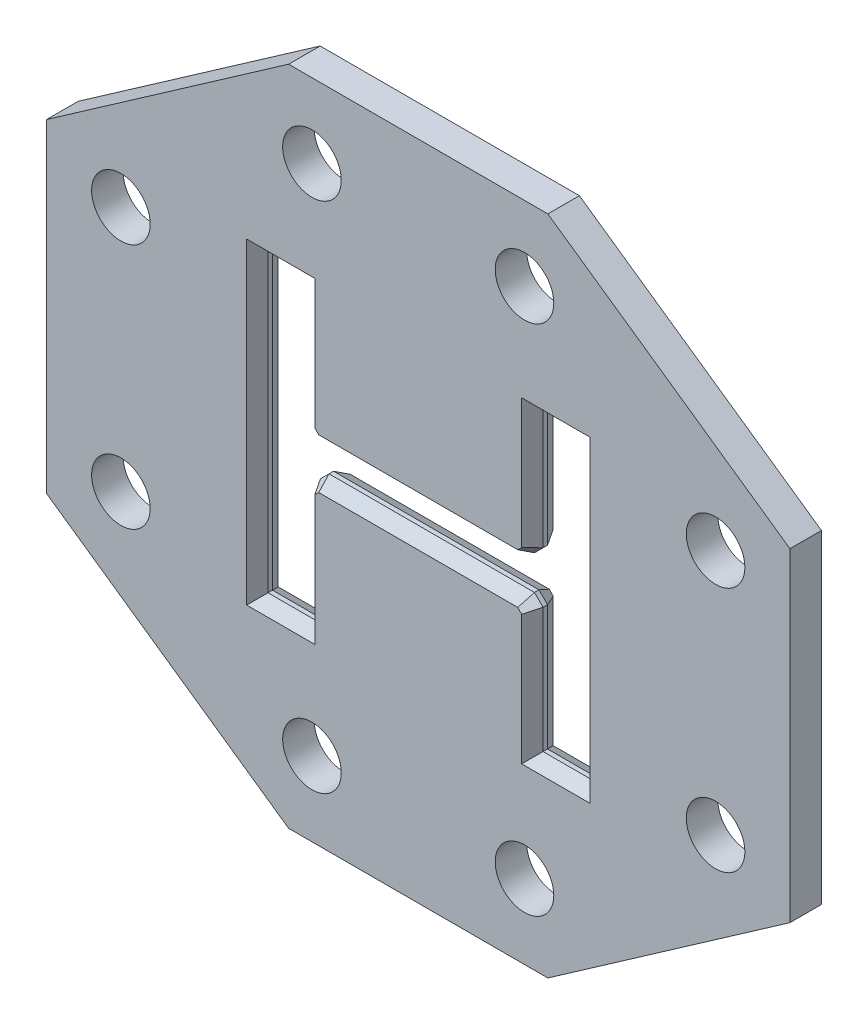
ISO-10303-21;
HEADER;
FILE_DESCRIPTION(('STEP AP214'),'2;1');
FILE_NAME('part.step','',(''),(''),'','','');
FILE_SCHEMA(('AUTOMOTIVE_DESIGN { 1 0 10303 214 1 1 1 1 }'));
ENDSEC;
DATA;
#1=APPLICATION_CONTEXT('core data for automotive mechanical design processes');
#2=APPLICATION_PROTOCOL_DEFINITION('international standard','automotive_design',2000,#1);
#3=PRODUCT_CONTEXT('',#1,'mechanical');
#4=PRODUCT('Part','Part','',(#3));
#5=PRODUCT_RELATED_PRODUCT_CATEGORY('part','',(#4));
#6=PRODUCT_DEFINITION_FORMATION('','',#4);
#7=PRODUCT_DEFINITION_CONTEXT('part definition',#1,'design');
#8=PRODUCT_DEFINITION('design','',#6,#7);
#9=PRODUCT_DEFINITION_SHAPE('','',#8);
#10=(LENGTH_UNIT() NAMED_UNIT(*) SI_UNIT(.MILLI.,.METRE.));
#11=(NAMED_UNIT(*) PLANE_ANGLE_UNIT() SI_UNIT($,.RADIAN.));
#12=(NAMED_UNIT(*) SI_UNIT($,.STERADIAN.) SOLID_ANGLE_UNIT());
#13=UNCERTAINTY_MEASURE_WITH_UNIT(LENGTH_MEASURE(1.E-05),#10,'distance_accuracy_value','');
#14=(GEOMETRIC_REPRESENTATION_CONTEXT(3) GLOBAL_UNCERTAINTY_ASSIGNED_CONTEXT((#13)) GLOBAL_UNIT_ASSIGNED_CONTEXT((#10,
#11,#12)) REPRESENTATION_CONTEXT('',''));
#15=CARTESIAN_POINT('',(0.,0.,0.));
#16=DIRECTION('',(0.,0.,1.));
#17=DIRECTION('',(1.,0.,0.));
#18=AXIS2_PLACEMENT_3D('',#15,#16,#17);
#19=CARTESIAN_POINT('',(156.845,-230.378,22.225));
#20=DIRECTION('',(1.,0.,0.));
#21=DIRECTION('',(0.,0.,-1.));
#22=AXIS2_PLACEMENT_3D('',#19,#20,#21);
#23=PLANE('',#22);
#24=DIRECTION('',(0.,0.,-1.));
#25=VECTOR('',#24,1.);
#26=CARTESIAN_POINT('',(156.845,-212.4075,22.225));
#27=LINE('',#26,#25);
#28=CARTESIAN_POINT('',(156.845,-212.4075,3.17244111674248));
#29=VERTEX_POINT('',#28);
#30=CARTESIAN_POINT('',(156.845,-212.4075,-3.17244111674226));
#31=VERTEX_POINT('',#30);
#32=EDGE_CURVE('E704',#29,#31,#27,.T.);
#33=ORIENTED_EDGE('',*,*,#32,.T.);
#34=DIRECTION('',(0.,1.,0.));
#35=VECTOR('',#34,1.);
#36=CARTESIAN_POINT('',(156.845,-230.378,-3.17244111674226));
#37=LINE('',#36,#35);
#38=CARTESIAN_POINT('',(156.845,-36.2584999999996,-3.17244111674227));
#39=VERTEX_POINT('',#38);
#40=EDGE_CURVE('E58',#31,#39,#37,.T.);
#41=ORIENTED_EDGE('',*,*,#40,.T.);
#42=DIRECTION('',(0.,0.,-1.));
#43=VECTOR('',#42,1.);
#44=CARTESIAN_POINT('',(156.845,-36.2584999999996,22.225));
#45=LINE('',#44,#43);
#46=CARTESIAN_POINT('',(156.845,-36.2584999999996,3.17244111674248));
#47=VERTEX_POINT('',#46);
#48=EDGE_CURVE('E709',#47,#39,#45,.T.);
#49=ORIENTED_EDGE('',*,*,#48,.F.);
#50=DIRECTION('',(0.,-1.,0.));
#51=VECTOR('',#50,1.);
#52=CARTESIAN_POINT('',(156.845,-212.4075,3.17244111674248));
#53=LINE('',#52,#51);
#54=EDGE_CURVE('E439',#47,#29,#53,.T.);
#55=ORIENTED_EDGE('',*,*,#54,.T.);
#56=EDGE_LOOP('',(#33,#41,#49,#55));
#57=FACE_BOUND('',#56,.T.);
#58=ADVANCED_FACE('F47',(#57),#23,.T.);
#59=CARTESIAN_POINT('',(-156.845,230.378,22.225));
#60=DIRECTION('',(-1.,0.,0.));
#61=DIRECTION('',(0.,0.,1.));
#62=AXIS2_PLACEMENT_3D('',#59,#60,#61);
#63=PLANE('',#62);
#64=DIRECTION('',(0.,0.,-1.));
#65=VECTOR('',#64,1.);
#66=CARTESIAN_POINT('',(-156.845,212.4075,22.225));
#67=LINE('',#66,#65);
#68=CARTESIAN_POINT('',(-156.845,212.4075,3.17244111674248));
#69=VERTEX_POINT('',#68);
#70=CARTESIAN_POINT('',(-156.845,212.4075,-3.17244111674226));
#71=VERTEX_POINT('',#70);
#72=EDGE_CURVE('E732',#69,#71,#67,.T.);
#73=ORIENTED_EDGE('',*,*,#72,.T.);
#74=DIRECTION('',(0.,-1.,0.));
#75=VECTOR('',#74,1.);
#76=CARTESIAN_POINT('',(-156.845,230.378,-3.17244111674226));
#77=LINE('',#76,#75);
#78=CARTESIAN_POINT('',(-156.845,36.2585000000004,-3.17244111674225));
#79=VERTEX_POINT('',#78);
#80=EDGE_CURVE('E573',#71,#79,#77,.T.);
#81=ORIENTED_EDGE('',*,*,#80,.T.);
#82=DIRECTION('',(0.,0.,-1.));
#83=VECTOR('',#82,1.);
#84=CARTESIAN_POINT('',(-156.845,36.2585000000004,22.225));
#85=LINE('',#84,#83);
#86=CARTESIAN_POINT('',(-156.845,36.2585000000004,3.17244111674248));
#87=VERTEX_POINT('',#86);
#88=EDGE_CURVE('E738',#87,#79,#85,.T.);
#89=ORIENTED_EDGE('',*,*,#88,.F.);
#90=DIRECTION('',(0.,1.,0.));
#91=VECTOR('',#90,1.);
#92=CARTESIAN_POINT('',(-156.845,212.4075,3.17244111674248));
#93=LINE('',#92,#91);
#94=EDGE_CURVE('E418',#87,#69,#93,.T.);
#95=ORIENTED_EDGE('',*,*,#94,.T.);
#96=EDGE_LOOP('',(#73,#81,#89,#95));
#97=FACE_BOUND('',#96,.T.);
#98=ADVANCED_FACE('F833',(#97),#63,.T.);
#99=CARTESIAN_POINT('',(0.,0.,22.225));
#100=DIRECTION('',(0.,0.,-1.));
#101=DIRECTION('',(-1.,0.,0.));
#102=AXIS2_PLACEMENT_3D('',#99,#100,#101);
#103=PLANE('',#102);
#104=DIRECTION('',(0.,-1.,0.));
#105=VECTOR('',#104,1.);
#106=CARTESIAN_POINT('',(241.759,-212.4075,22.225));
#107=LINE('',#106,#105);
#108=CARTESIAN_POINT('',(241.759,223.4075,22.225));
#109=VERTEX_POINT('',#108);
#110=CARTESIAN_POINT('',(241.759,-223.4075,22.225));
#111=VERTEX_POINT('',#110);
#112=EDGE_CURVE('E391',#109,#111,#107,.T.);
#113=ORIENTED_EDGE('',*,*,#112,.T.);
#114=DIRECTION('',(-1.,0.,0.));
#115=VECTOR('',#114,1.);
#116=CARTESIAN_POINT('',(156.845,-223.4075,22.225));
#117=LINE('',#116,#115);
#118=CARTESIAN_POINT('',(145.845,-223.4075,22.225));
#119=VERTEX_POINT('',#118);
#120=EDGE_CURVE('E393',#111,#119,#117,.T.);
#121=ORIENTED_EDGE('',*,*,#120,.T.);
#122=DIRECTION('',(0.,1.,0.));
#123=VECTOR('',#122,1.);
#124=CARTESIAN_POINT('',(145.845,-36.2584999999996,22.225));
#125=LINE('',#124,#123);
#126=CARTESIAN_POINT('',(145.845,-40.8148491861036,22.225));
#127=VERTEX_POINT('',#126);
#128=EDGE_CURVE('E344',#119,#127,#125,.T.);
#129=ORIENTED_EDGE('',*,*,#128,.T.);
#130=DIRECTION('',(-0.707106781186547,0.707106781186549,0.));
#131=VECTOR('',#130,1.);
#132=CARTESIAN_POINT('',(137.001825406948,-31.9716745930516,22.225));
#133=LINE('',#132,#131);
#134=CARTESIAN_POINT('',(140.223650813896,-35.1934999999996,22.225));
#135=VERTEX_POINT('',#134);
#136=EDGE_CURVE('E355',#127,#135,#133,.T.);
#137=ORIENTED_EDGE('',*,*,#136,.T.);
#138=DIRECTION('',(-1.,0.,0.));
#139=VECTOR('',#138,1.);
#140=CARTESIAN_POINT('',(-144.78,-35.1934999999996,22.225));
#141=LINE('',#140,#139);
#142=CARTESIAN_POINT('',(-140.223650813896,-35.1934999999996,22.225));
#143=VERTEX_POINT('',#142);
#144=EDGE_CURVE('E352',#135,#143,#141,.T.);
#145=ORIENTED_EDGE('',*,*,#144,.T.);
#146=DIRECTION('',(-0.707106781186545,-0.70710678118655,0.));
#147=VECTOR('',#146,1.);
#148=CARTESIAN_POINT('',(-149.066825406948,-44.0366745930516,22.225));
#149=LINE('',#148,#147);
#150=CARTESIAN_POINT('',(-145.845,-40.8148491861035,22.225));
#151=VERTEX_POINT('',#150);
#152=EDGE_CURVE('E356',#143,#151,#149,.T.);
#153=ORIENTED_EDGE('',*,*,#152,.T.);
#154=DIRECTION('',(0.,-1.,0.));
#155=VECTOR('',#154,1.);
#156=CARTESIAN_POINT('',(-145.845,-212.4075,22.225));
#157=LINE('',#156,#155);
#158=CARTESIAN_POINT('',(-145.845,-223.4075,22.225));
#159=VERTEX_POINT('',#158);
#160=EDGE_CURVE('E363',#151,#159,#157,.T.);
#161=ORIENTED_EDGE('',*,*,#160,.T.);
#162=DIRECTION('',(-1.,0.,0.));
#163=VECTOR('',#162,1.);
#164=CARTESIAN_POINT('',(-230.759,-223.4075,22.225));
#165=LINE('',#164,#163);
#166=CARTESIAN_POINT('',(-241.759,-223.4075,22.225));
#167=VERTEX_POINT('',#166);
#168=EDGE_CURVE('E364',#159,#167,#165,.T.);
#169=ORIENTED_EDGE('',*,*,#168,.T.);
#170=DIRECTION('',(0.,1.,0.));
#171=VECTOR('',#170,1.);
#172=CARTESIAN_POINT('',(-241.759,212.4075,22.225));
#173=LINE('',#172,#171);
#174=CARTESIAN_POINT('',(-241.759,223.4075,22.225));
#175=VERTEX_POINT('',#174);
#176=EDGE_CURVE('E370',#167,#175,#173,.T.);
#177=ORIENTED_EDGE('',*,*,#176,.T.);
#178=DIRECTION('',(1.,0.,0.));
#179=VECTOR('',#178,1.);
#180=CARTESIAN_POINT('',(-156.845,223.4075,22.225));
#181=LINE('',#180,#179);
#182=CARTESIAN_POINT('',(-145.845,223.4075,22.225));
#183=VERTEX_POINT('',#182);
#184=EDGE_CURVE('E369',#175,#183,#181,.T.);
#185=ORIENTED_EDGE('',*,*,#184,.T.);
#186=DIRECTION('',(0.,-1.,0.));
#187=VECTOR('',#186,1.);
#188=CARTESIAN_POINT('',(-145.845,36.2585000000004,22.225));
#189=LINE('',#188,#187);
#190=CARTESIAN_POINT('',(-145.845,40.8148491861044,22.225));
#191=VERTEX_POINT('',#190);
#192=EDGE_CURVE('E373',#183,#191,#189,.T.);
#193=ORIENTED_EDGE('',*,*,#192,.T.);
#194=DIRECTION('',(0.707106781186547,-0.707106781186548,0.));
#195=VECTOR('',#194,1.);
#196=CARTESIAN_POINT('',(-137.001825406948,31.9716745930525,22.225));
#197=LINE('',#196,#195);
#198=CARTESIAN_POINT('',(-140.223650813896,35.1935000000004,22.225));
#199=VERTEX_POINT('',#198);
#200=EDGE_CURVE('E376',#191,#199,#197,.T.);
#201=ORIENTED_EDGE('',*,*,#200,.T.);
#202=DIRECTION('',(1.,0.,0.));
#203=VECTOR('',#202,1.);
#204=CARTESIAN_POINT('',(144.78,35.1935000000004,22.225));
#205=LINE('',#204,#203);
#206=CARTESIAN_POINT('',(140.223650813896,35.1935000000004,22.225));
#207=VERTEX_POINT('',#206);
#208=EDGE_CURVE('E378',#199,#207,#205,.T.);
#209=ORIENTED_EDGE('',*,*,#208,.T.);
#210=DIRECTION('',(0.707106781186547,0.707106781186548,0.));
#211=VECTOR('',#210,1.);
#212=CARTESIAN_POINT('',(149.066825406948,44.0366745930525,22.225));
#213=LINE('',#212,#211);
#214=CARTESIAN_POINT('',(145.845,40.8148491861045,22.225));
#215=VERTEX_POINT('',#214);
#216=EDGE_CURVE('E385',#207,#215,#213,.T.);
#217=ORIENTED_EDGE('',*,*,#216,.T.);
#218=DIRECTION('',(0.,1.,0.));
#219=VECTOR('',#218,1.);
#220=CARTESIAN_POINT('',(145.845,212.4075,22.225));
#221=LINE('',#220,#219);
#222=CARTESIAN_POINT('',(145.845,223.4075,22.225));
#223=VERTEX_POINT('',#222);
#224=EDGE_CURVE('E383',#215,#223,#221,.T.);
#225=ORIENTED_EDGE('',*,*,#224,.T.);
#226=DIRECTION('',(1.,0.,0.));
#227=VECTOR('',#226,1.);
#228=CARTESIAN_POINT('',(230.759,223.4075,22.225));
#229=LINE('',#228,#227);
#230=EDGE_CURVE('E386',#223,#109,#229,.T.);
#231=ORIENTED_EDGE('',*,*,#230,.T.);
#232=EDGE_LOOP('',(#113,#121,#129,#137,#145,#153,#161,#169,#177,#185,#193,#201,#209,#217,#225,#231));
#233=FACE_BOUND('',#232,.T.);
#234=CARTESIAN_POINT('',(-149.758610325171,-361.549268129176,22.225));
#235=DIRECTION('',(0.,0.,1.));
#236=DIRECTION('',(1.,0.,0.));
#237=AXIS2_PLACEMENT_3D('',#234,#235,#236);
#238=CIRCLE('',#237,41.275);
#239=CARTESIAN_POINT('',(-108.483610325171,-361.549268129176,22.225));
#240=VERTEX_POINT('',#239);
#241=EDGE_CURVE('E1667',#240,#240,#238,.T.);
#242=ORIENTED_EDGE('',*,*,#241,.F.);
#243=EDGE_LOOP('',(#242));
#244=FACE_BOUND('',#243,.T.);
#245=CARTESIAN_POINT('',(149.758610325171,-361.549268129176,22.225));
#246=DIRECTION('',(0.,0.,1.));
#247=DIRECTION('',(1.,0.,0.));
#248=AXIS2_PLACEMENT_3D('',#245,#246,#247);
#249=CIRCLE('',#248,41.275);
#250=CARTESIAN_POINT('',(191.033610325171,-361.549268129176,22.225));
#251=VERTEX_POINT('',#250);
#252=EDGE_CURVE('E1673',#251,#251,#249,.T.);
#253=ORIENTED_EDGE('',*,*,#252,.F.);
#254=EDGE_LOOP('',(#253));
#255=FACE_BOUND('',#254,.T.);
#256=CARTESIAN_POINT('',(419.080268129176,-173.588730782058,22.225));
#257=DIRECTION('',(0.,0.,1.));
#258=DIRECTION('',(1.,0.,0.));
#259=AXIS2_PLACEMENT_3D('',#256,#257,#258);
#260=CIRCLE('',#259,41.275);
#261=CARTESIAN_POINT('',(460.355268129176,-173.588730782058,22.225));
#262=VERTEX_POINT('',#261);
#263=EDGE_CURVE('E1680',#262,#262,#260,.T.);
#264=ORIENTED_EDGE('',*,*,#263,.F.);
#265=EDGE_LOOP('',(#264));
#266=FACE_BOUND('',#265,.T.);
#267=CARTESIAN_POINT('',(419.080268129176,173.588730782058,22.225));
#268=DIRECTION('',(0.,0.,1.));
#269=DIRECTION('',(1.,0.,0.));
#270=AXIS2_PLACEMENT_3D('',#267,#268,#269);
#271=CIRCLE('',#270,41.275);
#272=CARTESIAN_POINT('',(460.355268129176,173.588730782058,22.225));
#273=VERTEX_POINT('',#272);
#274=EDGE_CURVE('E1682',#273,#273,#271,.T.);
#275=ORIENTED_EDGE('',*,*,#274,.F.);
#276=EDGE_LOOP('',(#275));
#277=FACE_BOUND('',#276,.T.);
#278=CARTESIAN_POINT('',(149.758610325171,361.549268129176,22.225));
#279=DIRECTION('',(0.,0.,1.));
#280=DIRECTION('',(1.,0.,0.));
#281=AXIS2_PLACEMENT_3D('',#278,#279,#280);
#282=CIRCLE('',#281,41.275);
#283=CARTESIAN_POINT('',(191.033610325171,361.549268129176,22.225));
#284=VERTEX_POINT('',#283);
#285=EDGE_CURVE('E1683',#284,#284,#282,.T.);
#286=ORIENTED_EDGE('',*,*,#285,.F.);
#287=EDGE_LOOP('',(#286));
#288=FACE_BOUND('',#287,.T.);
#289=CARTESIAN_POINT('',(-149.758610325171,361.549268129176,22.225));
#290=DIRECTION('',(0.,0.,1.));
#291=DIRECTION('',(1.,0.,0.));
#292=AXIS2_PLACEMENT_3D('',#289,#290,#291);
#293=CIRCLE('',#292,41.275);
#294=CARTESIAN_POINT('',(-108.483610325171,361.549268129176,22.225));
#295=VERTEX_POINT('',#294);
#296=EDGE_CURVE('E1689',#295,#295,#293,.T.);
#297=ORIENTED_EDGE('',*,*,#296,.F.);
#298=EDGE_LOOP('',(#297));
#299=FACE_BOUND('',#298,.T.);
#300=CARTESIAN_POINT('',(-419.080268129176,173.588730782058,22.225));
#301=DIRECTION('',(0.,0.,1.));
#302=DIRECTION('',(1.,0.,0.));
#303=AXIS2_PLACEMENT_3D('',#300,#301,#302);
#304=CIRCLE('',#303,41.275);
#305=CARTESIAN_POINT('',(-377.805268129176,173.588730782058,22.225));
#306=VERTEX_POINT('',#305);
#307=EDGE_CURVE('E1694',#306,#306,#304,.T.);
#308=ORIENTED_EDGE('',*,*,#307,.F.);
#309=EDGE_LOOP('',(#308));
#310=FACE_BOUND('',#309,.T.);
#311=CARTESIAN_POINT('',(-419.080268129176,-173.588730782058,22.225));
#312=DIRECTION('',(0.,0.,1.));
#313=DIRECTION('',(1.,0.,0.));
#314=AXIS2_PLACEMENT_3D('',#311,#312,#313);
#315=CIRCLE('',#314,41.275);
#316=CARTESIAN_POINT('',(-377.805268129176,-173.588730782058,22.225));
#317=VERTEX_POINT('',#316);
#318=EDGE_CURVE('E1698',#317,#317,#315,.T.);
#319=ORIENTED_EDGE('',*,*,#318,.F.);
#320=EDGE_LOOP('',(#319));
#321=FACE_BOUND('',#320,.T.);
#322=DIRECTION('',(0.,-1.,0.));
#323=VECTOR('',#322,1.);
#324=CARTESIAN_POINT('',(-523.855268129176,-228.234235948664,22.225));
#325=LINE('',#324,#323);
#326=CARTESIAN_POINT('',(-523.855268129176,228.234235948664,22.225));
#327=VERTEX_POINT('',#326);
#328=CARTESIAN_POINT('',(-523.855268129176,-228.234235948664,22.225));
#329=VERTEX_POINT('',#328);
#330=EDGE_CURVE('E321',#327,#329,#325,.T.);
#331=ORIENTED_EDGE('',*,*,#330,.T.);
#332=DIRECTION('',(0.820038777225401,-0.572307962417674,0.));
#333=VECTOR('',#332,1.);
#334=CARTESIAN_POINT('',(-182.70492307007,-466.324268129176,22.225));
#335=LINE('',#334,#333);
#336=CARTESIAN_POINT('',(-182.70492307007,-466.324268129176,22.225));
#337=VERTEX_POINT('',#336);
#338=EDGE_CURVE('E311',#329,#337,#335,.T.);
#339=ORIENTED_EDGE('',*,*,#338,.T.);
#340=DIRECTION('',(1.,0.,0.));
#341=VECTOR('',#340,1.);
#342=CARTESIAN_POINT('',(182.70492307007,-466.324268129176,22.225));
#343=LINE('',#342,#341);
#344=CARTESIAN_POINT('',(182.70492307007,-466.324268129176,22.225));
#345=VERTEX_POINT('',#344);
#346=EDGE_CURVE('E325',#337,#345,#343,.T.);
#347=ORIENTED_EDGE('',*,*,#346,.T.);
#348=DIRECTION('',(0.820038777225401,0.572307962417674,0.));
#349=VECTOR('',#348,1.);
#350=CARTESIAN_POINT('',(523.855268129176,-228.234235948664,22.225));
#351=LINE('',#350,#349);
#352=CARTESIAN_POINT('',(523.855268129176,-228.234235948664,22.225));
#353=VERTEX_POINT('',#352);
#354=EDGE_CURVE('E742',#345,#353,#351,.T.);
#355=ORIENTED_EDGE('',*,*,#354,.T.);
#356=DIRECTION('',(0.,1.,0.));
#357=VECTOR('',#356,1.);
#358=CARTESIAN_POINT('',(523.855268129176,228.234235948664,22.225));
#359=LINE('',#358,#357);
#360=CARTESIAN_POINT('',(523.855268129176,228.234235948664,22.225));
#361=VERTEX_POINT('',#360);
#362=EDGE_CURVE('E746',#353,#361,#359,.T.);
#363=ORIENTED_EDGE('',*,*,#362,.T.);
#364=DIRECTION('',(-0.820038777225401,0.572307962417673,0.));
#365=VECTOR('',#364,1.);
#366=CARTESIAN_POINT('',(182.70492307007,466.324268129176,22.225));
#367=LINE('',#366,#365);
#368=CARTESIAN_POINT('',(182.70492307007,466.324268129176,22.225));
#369=VERTEX_POINT('',#368);
#370=EDGE_CURVE('E753',#361,#369,#367,.T.);
#371=ORIENTED_EDGE('',*,*,#370,.T.);
#372=DIRECTION('',(-1.,0.,0.));
#373=VECTOR('',#372,1.);
#374=CARTESIAN_POINT('',(-182.704923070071,466.324268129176,22.225));
#375=LINE('',#374,#373);
#376=CARTESIAN_POINT('',(-182.704923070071,466.324268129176,22.225));
#377=VERTEX_POINT('',#376);
#378=EDGE_CURVE('E754',#369,#377,#375,.T.);
#379=ORIENTED_EDGE('',*,*,#378,.T.);
#380=DIRECTION('',(-0.8200387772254,-0.572307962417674,0.));
#381=VECTOR('',#380,1.);
#382=CARTESIAN_POINT('',(-523.855268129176,228.234235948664,22.225));
#383=LINE('',#382,#381);
#384=EDGE_CURVE('E329',#377,#327,#383,.T.);
#385=ORIENTED_EDGE('',*,*,#384,.T.);
#386=EDGE_LOOP('',(#331,#339,#347,#355,#363,#371,#379,#385));
#387=FACE_BOUND('',#386,.T.);
#388=ADVANCED_FACE('F326',(#233,#244,#255,#266,#277,#288,#299,#310,#321,#387),#103,.F.);
#389=CARTESIAN_POINT('',(0.,0.,-22.225));
#390=DIRECTION('',(0.,0.,-1.));
#391=DIRECTION('',(-1.,0.,0.));
#392=AXIS2_PLACEMENT_3D('',#389,#390,#391);
#393=PLANE('',#392);
#394=DIRECTION('',(0.707106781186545,0.70710678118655,0.));
#395=VECTOR('',#394,1.);
#396=CARTESIAN_POINT('',(-52.5150754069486,52.5150754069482,-22.225));
#397=LINE('',#396,#395);
#398=CARTESIAN_POINT('',(-145.845,-40.8148491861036,-22.225));
#399=VERTEX_POINT('',#398);
#400=CARTESIAN_POINT('',(-140.223650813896,-35.1934999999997,-22.225));
#401=VERTEX_POINT('',#400);
#402=EDGE_CURVE('E546',#399,#401,#397,.T.);
#403=ORIENTED_EDGE('',*,*,#402,.T.);
#404=DIRECTION('',(1.,0.,0.));
#405=VECTOR('',#404,1.);
#406=CARTESIAN_POINT('',(0.,-35.1934999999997,-22.225));
#407=LINE('',#406,#405);
#408=CARTESIAN_POINT('',(140.223650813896,-35.1934999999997,-22.225));
#409=VERTEX_POINT('',#408);
#410=EDGE_CURVE('E553',#401,#409,#407,.T.);
#411=ORIENTED_EDGE('',*,*,#410,.T.);
#412=DIRECTION('',(0.707106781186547,-0.707106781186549,0.));
#413=VECTOR('',#412,1.);
#414=CARTESIAN_POINT('',(52.5150754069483,52.5150754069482,-22.225));
#415=LINE('',#414,#413);
#416=CARTESIAN_POINT('',(145.845,-40.8148491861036,-22.225));
#417=VERTEX_POINT('',#416);
#418=EDGE_CURVE('E442',#409,#417,#415,.T.);
#419=ORIENTED_EDGE('',*,*,#418,.T.);
#420=DIRECTION('',(0.,-1.,0.));
#421=VECTOR('',#420,1.);
#422=CARTESIAN_POINT('',(145.845,0.,-22.225));
#423=LINE('',#422,#421);
#424=CARTESIAN_POINT('',(145.845,-223.4075,-22.225));
#425=VERTEX_POINT('',#424);
#426=EDGE_CURVE('E508',#417,#425,#423,.T.);
#427=ORIENTED_EDGE('',*,*,#426,.T.);
#428=DIRECTION('',(1.,0.,0.));
#429=VECTOR('',#428,1.);
#430=CARTESIAN_POINT('',(0.,-223.4075,-22.225));
#431=LINE('',#430,#429);
#432=CARTESIAN_POINT('',(241.759,-223.4075,-22.225));
#433=VERTEX_POINT('',#432);
#434=EDGE_CURVE('E515',#425,#433,#431,.T.);
#435=ORIENTED_EDGE('',*,*,#434,.T.);
#436=DIRECTION('',(0.,1.,0.));
#437=VECTOR('',#436,1.);
#438=CARTESIAN_POINT('',(241.759,0.,-22.225));
#439=LINE('',#438,#437);
#440=CARTESIAN_POINT('',(241.759,223.407500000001,-22.225));
#441=VERTEX_POINT('',#440);
#442=EDGE_CURVE('E513',#433,#441,#439,.T.);
#443=ORIENTED_EDGE('',*,*,#442,.T.);
#444=DIRECTION('',(-1.,0.,0.));
#445=VECTOR('',#444,1.);
#446=CARTESIAN_POINT('',(0.,223.407500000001,-22.225));
#447=LINE('',#446,#445);
#448=CARTESIAN_POINT('',(145.845,223.407500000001,-22.225));
#449=VERTEX_POINT('',#448);
#450=EDGE_CURVE('E516',#441,#449,#447,.T.);
#451=ORIENTED_EDGE('',*,*,#450,.T.);
#452=DIRECTION('',(0.,-1.,0.));
#453=VECTOR('',#452,1.);
#454=CARTESIAN_POINT('',(145.845,0.,-22.225));
#455=LINE('',#454,#453);
#456=CARTESIAN_POINT('',(145.845,40.8148491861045,-22.225));
#457=VERTEX_POINT('',#456);
#458=EDGE_CURVE('E521',#449,#457,#455,.T.);
#459=ORIENTED_EDGE('',*,*,#458,.T.);
#460=DIRECTION('',(-0.707106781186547,-0.707106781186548,0.));
#461=VECTOR('',#460,1.);
#462=CARTESIAN_POINT('',(52.5150754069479,-52.5150754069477,-22.225));
#463=LINE('',#462,#461);
#464=CARTESIAN_POINT('',(140.223650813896,35.1935000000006,-22.225));
#465=VERTEX_POINT('',#464);
#466=EDGE_CURVE('E523',#457,#465,#463,.T.);
#467=ORIENTED_EDGE('',*,*,#466,.T.);
#468=DIRECTION('',(-1.,0.,0.));
#469=VECTOR('',#468,1.);
#470=CARTESIAN_POINT('',(0.,35.1935000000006,-22.225));
#471=LINE('',#470,#469);
#472=CARTESIAN_POINT('',(-140.223650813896,35.1935000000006,-22.225));
#473=VERTEX_POINT('',#472);
#474=EDGE_CURVE('E530',#465,#473,#471,.T.);
#475=ORIENTED_EDGE('',*,*,#474,.T.);
#476=DIRECTION('',(-0.707106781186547,0.707106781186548,0.));
#477=VECTOR('',#476,1.);
#478=CARTESIAN_POINT('',(-52.5150754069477,-52.5150754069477,-22.225));
#479=LINE('',#478,#477);
#480=CARTESIAN_POINT('',(-145.845,40.8148491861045,-22.225));
#481=VERTEX_POINT('',#480);
#482=EDGE_CURVE('E527',#473,#481,#479,.T.);
#483=ORIENTED_EDGE('',*,*,#482,.T.);
#484=DIRECTION('',(0.,1.,0.));
#485=VECTOR('',#484,1.);
#486=CARTESIAN_POINT('',(-145.845,0.,-22.225));
#487=LINE('',#486,#485);
#488=CARTESIAN_POINT('',(-145.845,223.407500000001,-22.225));
#489=VERTEX_POINT('',#488);
#490=EDGE_CURVE('E531',#481,#489,#487,.T.);
#491=ORIENTED_EDGE('',*,*,#490,.T.);
#492=DIRECTION('',(-1.,0.,0.));
#493=VECTOR('',#492,1.);
#494=CARTESIAN_POINT('',(0.,223.407500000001,-22.225));
#495=LINE('',#494,#493);
#496=CARTESIAN_POINT('',(-241.759,223.407500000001,-22.225));
#497=VERTEX_POINT('',#496);
#498=EDGE_CURVE('E538',#489,#497,#495,.T.);
#499=ORIENTED_EDGE('',*,*,#498,.T.);
#500=DIRECTION('',(0.,-1.,0.));
#501=VECTOR('',#500,1.);
#502=CARTESIAN_POINT('',(-241.759,0.,-22.225));
#503=LINE('',#502,#501);
#504=CARTESIAN_POINT('',(-241.759,-223.4075,-22.225));
#505=VERTEX_POINT('',#504);
#506=EDGE_CURVE('E539',#497,#505,#503,.T.);
#507=ORIENTED_EDGE('',*,*,#506,.T.);
#508=DIRECTION('',(1.,0.,0.));
#509=VECTOR('',#508,1.);
#510=CARTESIAN_POINT('',(0.,-223.4075,-22.225));
#511=LINE('',#510,#509);
#512=CARTESIAN_POINT('',(-145.845,-223.4075,-22.225));
#513=VERTEX_POINT('',#512);
#514=EDGE_CURVE('E542',#505,#513,#511,.T.);
#515=ORIENTED_EDGE('',*,*,#514,.T.);
#516=DIRECTION('',(0.,1.,0.));
#517=VECTOR('',#516,1.);
#518=CARTESIAN_POINT('',(-145.845,0.,-22.225));
#519=LINE('',#518,#517);
#520=EDGE_CURVE('E545',#513,#399,#519,.T.);
#521=ORIENTED_EDGE('',*,*,#520,.T.);
#522=EDGE_LOOP('',(#403,#411,#419,#427,#435,#443,#451,#459,#467,#475,#483,#491,#499,#507,#515,#521));
#523=FACE_BOUND('',#522,.T.);
#524=CARTESIAN_POINT('',(-149.758610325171,-361.549268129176,-22.225));
#525=DIRECTION('',(0.,0.,1.));
#526=DIRECTION('',(1.,0.,0.));
#527=AXIS2_PLACEMENT_3D('',#524,#525,#526);
#528=CIRCLE('',#527,41.275);
#529=CARTESIAN_POINT('',(-108.483610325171,-361.549268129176,-22.225));
#530=VERTEX_POINT('',#529);
#531=EDGE_CURVE('E506',#530,#530,#528,.T.);
#532=ORIENTED_EDGE('',*,*,#531,.T.);
#533=EDGE_LOOP('',(#532));
#534=FACE_BOUND('',#533,.T.);
#535=CARTESIAN_POINT('',(149.758610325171,-361.549268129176,-22.225));
#536=DIRECTION('',(0.,0.,1.));
#537=DIRECTION('',(1.,0.,0.));
#538=AXIS2_PLACEMENT_3D('',#535,#536,#537);
#539=CIRCLE('',#538,41.275);
#540=CARTESIAN_POINT('',(191.033610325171,-361.549268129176,-22.225));
#541=VERTEX_POINT('',#540);
#542=EDGE_CURVE('E1706',#541,#541,#539,.T.);
#543=ORIENTED_EDGE('',*,*,#542,.T.);
#544=EDGE_LOOP('',(#543));
#545=FACE_BOUND('',#544,.T.);
#546=CARTESIAN_POINT('',(419.080268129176,-173.588730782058,-22.225));
#547=DIRECTION('',(0.,0.,1.));
#548=DIRECTION('',(1.,0.,0.));
#549=AXIS2_PLACEMENT_3D('',#546,#547,#548);
#550=CIRCLE('',#549,41.275);
#551=CARTESIAN_POINT('',(460.355268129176,-173.588730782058,-22.225));
#552=VERTEX_POINT('',#551);
#553=EDGE_CURVE('E1713',#552,#552,#550,.T.);
#554=ORIENTED_EDGE('',*,*,#553,.T.);
#555=EDGE_LOOP('',(#554));
#556=FACE_BOUND('',#555,.T.);
#557=CARTESIAN_POINT('',(419.080268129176,173.588730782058,-22.225));
#558=DIRECTION('',(0.,0.,1.));
#559=DIRECTION('',(1.,0.,0.));
#560=AXIS2_PLACEMENT_3D('',#557,#558,#559);
#561=CIRCLE('',#560,41.275);
#562=CARTESIAN_POINT('',(460.355268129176,173.588730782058,-22.225));
#563=VERTEX_POINT('',#562);
#564=EDGE_CURVE('E1717',#563,#563,#561,.T.);
#565=ORIENTED_EDGE('',*,*,#564,.T.);
#566=EDGE_LOOP('',(#565));
#567=FACE_BOUND('',#566,.T.);
#568=CARTESIAN_POINT('',(149.758610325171,361.549268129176,-22.225));
#569=DIRECTION('',(0.,0.,1.));
#570=DIRECTION('',(1.,0.,0.));
#571=AXIS2_PLACEMENT_3D('',#568,#569,#570);
#572=CIRCLE('',#571,41.275);
#573=CARTESIAN_POINT('',(191.033610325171,361.549268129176,-22.225));
#574=VERTEX_POINT('',#573);
#575=EDGE_CURVE('E1728',#574,#574,#572,.T.);
#576=ORIENTED_EDGE('',*,*,#575,.T.);
#577=EDGE_LOOP('',(#576));
#578=FACE_BOUND('',#577,.T.);
#579=CARTESIAN_POINT('',(-149.758610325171,361.549268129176,-22.225));
#580=DIRECTION('',(0.,0.,1.));
#581=DIRECTION('',(1.,0.,0.));
#582=AXIS2_PLACEMENT_3D('',#579,#580,#581);
#583=CIRCLE('',#582,41.275);
#584=CARTESIAN_POINT('',(-108.483610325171,361.549268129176,-22.225));
#585=VERTEX_POINT('',#584);
#586=EDGE_CURVE('E1735',#585,#585,#583,.T.);
#587=ORIENTED_EDGE('',*,*,#586,.T.);
#588=EDGE_LOOP('',(#587));
#589=FACE_BOUND('',#588,.T.);
#590=CARTESIAN_POINT('',(-419.080268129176,173.588730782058,-22.225));
#591=DIRECTION('',(0.,0.,1.));
#592=DIRECTION('',(1.,0.,0.));
#593=AXIS2_PLACEMENT_3D('',#590,#591,#592);
#594=CIRCLE('',#593,41.275);
#595=CARTESIAN_POINT('',(-377.805268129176,173.588730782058,-22.225));
#596=VERTEX_POINT('',#595);
#597=EDGE_CURVE('E1701',#596,#596,#594,.T.);
#598=ORIENTED_EDGE('',*,*,#597,.T.);
#599=EDGE_LOOP('',(#598));
#600=FACE_BOUND('',#599,.T.);
#601=CARTESIAN_POINT('',(-419.080268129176,-173.588730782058,-22.225));
#602=DIRECTION('',(0.,0.,1.));
#603=DIRECTION('',(1.,0.,0.));
#604=AXIS2_PLACEMENT_3D('',#601,#602,#603);
#605=CIRCLE('',#604,41.275);
#606=CARTESIAN_POINT('',(-377.805268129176,-173.588730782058,-22.225));
#607=VERTEX_POINT('',#606);
#608=EDGE_CURVE('E691',#607,#607,#605,.T.);
#609=ORIENTED_EDGE('',*,*,#608,.T.);
#610=EDGE_LOOP('',(#609));
#611=FACE_BOUND('',#610,.T.);
#612=DIRECTION('',(0.,-1.,0.));
#613=VECTOR('',#612,1.);
#614=CARTESIAN_POINT('',(-523.855268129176,-228.234235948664,-22.225));
#615=LINE('',#614,#613);
#616=CARTESIAN_POINT('',(-523.855268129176,228.234235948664,-22.225));
#617=VERTEX_POINT('',#616);
#618=CARTESIAN_POINT('',(-523.855268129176,-228.234235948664,-22.225));
#619=VERTEX_POINT('',#618);
#620=EDGE_CURVE('E340',#617,#619,#615,.T.);
#621=ORIENTED_EDGE('',*,*,#620,.F.);
#622=DIRECTION('',(-0.8200387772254,-0.572307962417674,0.));
#623=VECTOR('',#622,1.);
#624=CARTESIAN_POINT('',(-523.855268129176,228.234235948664,-22.225));
#625=LINE('',#624,#623);
#626=CARTESIAN_POINT('',(-182.704923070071,466.324268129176,-22.225));
#627=VERTEX_POINT('',#626);
#628=EDGE_CURVE('E331',#627,#617,#625,.T.);
#629=ORIENTED_EDGE('',*,*,#628,.F.);
#630=DIRECTION('',(-1.,0.,0.));
#631=VECTOR('',#630,1.);
#632=CARTESIAN_POINT('',(-182.704923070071,466.324268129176,-22.225));
#633=LINE('',#632,#631);
#634=CARTESIAN_POINT('',(182.70492307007,466.324268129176,-22.225));
#635=VERTEX_POINT('',#634);
#636=EDGE_CURVE('E780',#635,#627,#633,.T.);
#637=ORIENTED_EDGE('',*,*,#636,.F.);
#638=DIRECTION('',(-0.820038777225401,0.572307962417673,0.));
#639=VECTOR('',#638,1.);
#640=CARTESIAN_POINT('',(182.70492307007,466.324268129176,-22.225));
#641=LINE('',#640,#639);
#642=CARTESIAN_POINT('',(523.855268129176,228.234235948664,-22.225));
#643=VERTEX_POINT('',#642);
#644=EDGE_CURVE('E771',#643,#635,#641,.T.);
#645=ORIENTED_EDGE('',*,*,#644,.F.);
#646=DIRECTION('',(0.,1.,0.));
#647=VECTOR('',#646,1.);
#648=CARTESIAN_POINT('',(523.855268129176,228.234235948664,-22.225));
#649=LINE('',#648,#647);
#650=CARTESIAN_POINT('',(523.855268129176,-228.234235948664,-22.225));
#651=VERTEX_POINT('',#650);
#652=EDGE_CURVE('E772',#651,#643,#649,.T.);
#653=ORIENTED_EDGE('',*,*,#652,.F.);
#654=DIRECTION('',(0.820038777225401,0.572307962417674,0.));
#655=VECTOR('',#654,1.);
#656=CARTESIAN_POINT('',(523.855268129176,-228.234235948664,-22.225));
#657=LINE('',#656,#655);
#658=CARTESIAN_POINT('',(182.70492307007,-466.324268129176,-22.225));
#659=VERTEX_POINT('',#658);
#660=EDGE_CURVE('E767',#659,#651,#657,.T.);
#661=ORIENTED_EDGE('',*,*,#660,.F.);
#662=DIRECTION('',(1.,0.,0.));
#663=VECTOR('',#662,1.);
#664=CARTESIAN_POINT('',(182.70492307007,-466.324268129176,-22.225));
#665=LINE('',#664,#663);
#666=CARTESIAN_POINT('',(-182.70492307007,-466.324268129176,-22.225));
#667=VERTEX_POINT('',#666);
#668=EDGE_CURVE('E764',#667,#659,#665,.T.);
#669=ORIENTED_EDGE('',*,*,#668,.F.);
#670=DIRECTION('',(0.820038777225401,-0.572307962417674,0.));
#671=VECTOR('',#670,1.);
#672=CARTESIAN_POINT('',(-182.70492307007,-466.324268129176,-22.225));
#673=LINE('',#672,#671);
#674=EDGE_CURVE('E765',#619,#667,#673,.T.);
#675=ORIENTED_EDGE('',*,*,#674,.F.);
#676=EDGE_LOOP('',(#621,#629,#637,#645,#653,#661,#669,#675));
#677=FACE_BOUND('',#676,.T.);
#678=ADVANCED_FACE('F813',(#523,#534,#545,#556,#567,#578,#589,#600,#611,#677),#393,.T.);
#679=CARTESIAN_POINT('',(-523.855268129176,-228.234235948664,22.225));
#680=DIRECTION('',(1.,0.,0.));
#681=DIRECTION('',(0.,0.,-1.));
#682=AXIS2_PLACEMENT_3D('',#679,#680,#681);
#683=PLANE('',#682);
#684=ORIENTED_EDGE('',*,*,#620,.T.);
#685=DIRECTION('',(0.,0.,-1.));
#686=VECTOR('',#685,1.);
#687=CARTESIAN_POINT('',(-523.855268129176,-228.234235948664,22.225));
#688=LINE('',#687,#686);
#689=EDGE_CURVE('E314',#329,#619,#688,.T.);
#690=ORIENTED_EDGE('',*,*,#689,.F.);
#691=ORIENTED_EDGE('',*,*,#330,.F.);
#692=DIRECTION('',(0.,0.,-1.));
#693=VECTOR('',#692,1.);
#694=CARTESIAN_POINT('',(-523.855268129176,228.234235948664,22.225));
#695=LINE('',#694,#693);
#696=EDGE_CURVE('E757',#327,#617,#695,.T.);
#697=ORIENTED_EDGE('',*,*,#696,.T.);
#698=EDGE_LOOP('',(#684,#690,#691,#697));
#699=FACE_BOUND('',#698,.T.);
#700=ADVANCED_FACE('F332',(#699),#683,.F.);
#701=CARTESIAN_POINT('',(-182.70492307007,-466.324268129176,22.225));
#702=DIRECTION('',(0.572307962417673,0.820038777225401,0.));
#703=DIRECTION('',(-0.820038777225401,0.572307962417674,0.));
#704=AXIS2_PLACEMENT_3D('',#701,#702,#703);
#705=PLANE('',#704);
#706=ORIENTED_EDGE('',*,*,#674,.T.);
#707=DIRECTION('',(0.,0.,-1.));
#708=VECTOR('',#707,1.);
#709=CARTESIAN_POINT('',(-182.70492307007,-466.324268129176,22.225));
#710=LINE('',#709,#708);
#711=EDGE_CURVE('E319',#337,#667,#710,.T.);
#712=ORIENTED_EDGE('',*,*,#711,.F.);
#713=ORIENTED_EDGE('',*,*,#338,.F.);
#714=ORIENTED_EDGE('',*,*,#689,.T.);
#715=EDGE_LOOP('',(#706,#712,#713,#714));
#716=FACE_BOUND('',#715,.T.);
#717=ADVANCED_FACE('F312',(#716),#705,.F.);
#718=CARTESIAN_POINT('',(182.70492307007,-466.324268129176,22.225));
#719=DIRECTION('',(0.,1.,0.));
#720=DIRECTION('',(0.,0.,1.));
#721=AXIS2_PLACEMENT_3D('',#718,#719,#720);
#722=PLANE('',#721);
#723=ORIENTED_EDGE('',*,*,#668,.T.);
#724=DIRECTION('',(0.,0.,-1.));
#725=VECTOR('',#724,1.);
#726=CARTESIAN_POINT('',(182.70492307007,-466.324268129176,22.225));
#727=LINE('',#726,#725);
#728=EDGE_CURVE('E346',#345,#659,#727,.T.);
#729=ORIENTED_EDGE('',*,*,#728,.F.);
#730=ORIENTED_EDGE('',*,*,#346,.F.);
#731=ORIENTED_EDGE('',*,*,#711,.T.);
#732=EDGE_LOOP('',(#723,#729,#730,#731));
#733=FACE_BOUND('',#732,.T.);
#734=ADVANCED_FACE('F822',(#733),#722,.F.);
#735=CARTESIAN_POINT('',(523.855268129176,-228.234235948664,22.225));
#736=DIRECTION('',(-0.572307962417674,0.820038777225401,0.));
#737=DIRECTION('',(-0.820038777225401,-0.572307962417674,0.));
#738=AXIS2_PLACEMENT_3D('',#735,#736,#737);
#739=PLANE('',#738);
#740=ORIENTED_EDGE('',*,*,#660,.T.);
#741=DIRECTION('',(0.,0.,-1.));
#742=VECTOR('',#741,1.);
#743=CARTESIAN_POINT('',(523.855268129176,-228.234235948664,22.225));
#744=LINE('',#743,#742);
#745=EDGE_CURVE('E798',#353,#651,#744,.T.);
#746=ORIENTED_EDGE('',*,*,#745,.F.);
#747=ORIENTED_EDGE('',*,*,#354,.F.);
#748=ORIENTED_EDGE('',*,*,#728,.T.);
#749=EDGE_LOOP('',(#740,#746,#747,#748));
#750=FACE_BOUND('',#749,.T.);
#751=ADVANCED_FACE('F805',(#750),#739,.F.);
#752=CARTESIAN_POINT('',(523.855268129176,228.234235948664,22.225));
#753=DIRECTION('',(-1.,0.,0.));
#754=DIRECTION('',(0.,-1.,0.));
#755=AXIS2_PLACEMENT_3D('',#752,#753,#754);
#756=PLANE('',#755);
#757=ORIENTED_EDGE('',*,*,#652,.T.);
#758=DIRECTION('',(0.,0.,-1.));
#759=VECTOR('',#758,1.);
#760=CARTESIAN_POINT('',(523.855268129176,228.234235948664,22.225));
#761=LINE('',#760,#759);
#762=EDGE_CURVE('E795',#361,#643,#761,.T.);
#763=ORIENTED_EDGE('',*,*,#762,.F.);
#764=ORIENTED_EDGE('',*,*,#362,.F.);
#765=ORIENTED_EDGE('',*,*,#745,.T.);
#766=EDGE_LOOP('',(#757,#763,#764,#765));
#767=FACE_BOUND('',#766,.T.);
#768=ADVANCED_FACE('F818',(#767),#756,.F.);
#769=CARTESIAN_POINT('',(182.70492307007,466.324268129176,22.225));
#770=DIRECTION('',(-0.572307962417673,-0.820038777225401,0.));
#771=DIRECTION('',(0.820038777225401,-0.572307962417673,0.));
#772=AXIS2_PLACEMENT_3D('',#769,#770,#771);
#773=PLANE('',#772);
#774=ORIENTED_EDGE('',*,*,#644,.T.);
#775=DIRECTION('',(0.,0.,-1.));
#776=VECTOR('',#775,1.);
#777=CARTESIAN_POINT('',(182.70492307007,466.324268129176,22.225));
#778=LINE('',#777,#776);
#779=EDGE_CURVE('E786',#369,#635,#778,.T.);
#780=ORIENTED_EDGE('',*,*,#779,.F.);
#781=ORIENTED_EDGE('',*,*,#370,.F.);
#782=ORIENTED_EDGE('',*,*,#762,.T.);
#783=EDGE_LOOP('',(#774,#780,#781,#782));
#784=FACE_BOUND('',#783,.T.);
#785=ADVANCED_FACE('F817',(#784),#773,.F.);
#786=CARTESIAN_POINT('',(-182.704923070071,466.324268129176,22.225));
#787=DIRECTION('',(0.,-1.,0.));
#788=DIRECTION('',(1.,0.,0.));
#789=AXIS2_PLACEMENT_3D('',#786,#787,#788);
#790=PLANE('',#789);
#791=ORIENTED_EDGE('',*,*,#636,.T.);
#792=DIRECTION('',(0.,0.,-1.));
#793=VECTOR('',#792,1.);
#794=CARTESIAN_POINT('',(-182.704923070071,466.324268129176,22.225));
#795=LINE('',#794,#793);
#796=EDGE_CURVE('E783',#377,#627,#795,.T.);
#797=ORIENTED_EDGE('',*,*,#796,.F.);
#798=ORIENTED_EDGE('',*,*,#378,.F.);
#799=ORIENTED_EDGE('',*,*,#779,.T.);
#800=EDGE_LOOP('',(#791,#797,#798,#799));
#801=FACE_BOUND('',#800,.T.);
#802=ADVANCED_FACE('F854',(#801),#790,.F.);
#803=CARTESIAN_POINT('',(-523.855268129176,228.234235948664,22.225));
#804=DIRECTION('',(0.572307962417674,-0.8200387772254,0.));
#805=DIRECTION('',(0.820038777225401,0.572307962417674,0.));
#806=AXIS2_PLACEMENT_3D('',#803,#804,#805);
#807=PLANE('',#806);
#808=ORIENTED_EDGE('',*,*,#628,.T.);
#809=ORIENTED_EDGE('',*,*,#696,.F.);
#810=ORIENTED_EDGE('',*,*,#384,.F.);
#811=ORIENTED_EDGE('',*,*,#796,.T.);
#812=EDGE_LOOP('',(#808,#809,#810,#811));
#813=FACE_BOUND('',#812,.T.);
#814=ADVANCED_FACE('F853',(#813),#807,.F.);
#815=CARTESIAN_POINT('',(156.845,54.2290000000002,22.225));
#816=DIRECTION('',(1.,0.,0.));
#817=DIRECTION('',(0.,0.,-1.));
#818=AXIS2_PLACEMENT_3D('',#815,#816,#817);
#819=PLANE('',#818);
#820=DIRECTION('',(0.,0.,-1.));
#821=VECTOR('',#820,1.);
#822=CARTESIAN_POINT('',(156.845,36.2585000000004,22.225));
#823=LINE('',#822,#821);
#824=CARTESIAN_POINT('',(156.845,36.2585000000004,3.17244111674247));
#825=VERTEX_POINT('',#824);
#826=CARTESIAN_POINT('',(156.845,36.2585000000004,-3.17244111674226));
#827=VERTEX_POINT('',#826);
#828=EDGE_CURVE('E684',#825,#827,#823,.T.);
#829=ORIENTED_EDGE('',*,*,#828,.T.);
#830=DIRECTION('',(0.,1.,0.));
#831=VECTOR('',#830,1.);
#832=CARTESIAN_POINT('',(156.845,54.2290000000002,-3.17244111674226));
#833=LINE('',#832,#831);
#834=CARTESIAN_POINT('',(156.845,212.4075,-3.17244111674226));
#835=VERTEX_POINT('',#834);
#836=EDGE_CURVE('E586',#827,#835,#833,.T.);
#837=ORIENTED_EDGE('',*,*,#836,.T.);
#838=DIRECTION('',(0.,0.,-1.));
#839=VECTOR('',#838,1.);
#840=CARTESIAN_POINT('',(156.845,212.4075,22.225));
#841=LINE('',#840,#839);
#842=CARTESIAN_POINT('',(156.845,212.4075,3.17244111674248));
#843=VERTEX_POINT('',#842);
#844=EDGE_CURVE('E689',#843,#835,#841,.T.);
#845=ORIENTED_EDGE('',*,*,#844,.F.);
#846=DIRECTION('',(0.,-1.,0.));
#847=VECTOR('',#846,1.);
#848=CARTESIAN_POINT('',(156.845,36.2585000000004,3.17244111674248));
#849=LINE('',#848,#847);
#850=EDGE_CURVE('E404',#843,#825,#849,.T.);
#851=ORIENTED_EDGE('',*,*,#850,.T.);
#852=EDGE_LOOP('',(#829,#837,#845,#851));
#853=FACE_BOUND('',#852,.T.);
#854=ADVANCED_FACE('F844',(#853),#819,.T.);
#855=CARTESIAN_POINT('',(-156.845,-54.2289999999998,22.225));
#856=DIRECTION('',(-1.,0.,0.));
#857=DIRECTION('',(0.,0.,1.));
#858=AXIS2_PLACEMENT_3D('',#855,#856,#857);
#859=PLANE('',#858);
#860=DIRECTION('',(0.,0.,-1.));
#861=VECTOR('',#860,1.);
#862=CARTESIAN_POINT('',(-156.845,-36.2584999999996,22.225));
#863=LINE('',#862,#861);
#864=CARTESIAN_POINT('',(-156.845,-36.2584999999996,3.17244111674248));
#865=VERTEX_POINT('',#864);
#866=CARTESIAN_POINT('',(-156.845,-36.2584999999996,-3.17244111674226));
#867=VERTEX_POINT('',#866);
#868=EDGE_CURVE('E718',#865,#867,#863,.T.);
#869=ORIENTED_EDGE('',*,*,#868,.T.);
#870=DIRECTION('',(0.,-1.,0.));
#871=VECTOR('',#870,1.);
#872=CARTESIAN_POINT('',(-156.845,-54.2289999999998,-3.17244111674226));
#873=LINE('',#872,#871);
#874=CARTESIAN_POINT('',(-156.845,-212.4075,-3.17244111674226));
#875=VERTEX_POINT('',#874);
#876=EDGE_CURVE('E565',#867,#875,#873,.T.);
#877=ORIENTED_EDGE('',*,*,#876,.T.);
#878=DIRECTION('',(0.,0.,-1.));
#879=VECTOR('',#878,1.);
#880=CARTESIAN_POINT('',(-156.845,-212.4075,22.225));
#881=LINE('',#880,#879);
#882=CARTESIAN_POINT('',(-156.845,-212.4075,3.17244111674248));
#883=VERTEX_POINT('',#882);
#884=EDGE_CURVE('E721',#883,#875,#881,.T.);
#885=ORIENTED_EDGE('',*,*,#884,.F.);
#886=DIRECTION('',(0.,1.,0.));
#887=VECTOR('',#886,1.);
#888=CARTESIAN_POINT('',(-156.845,-36.2584999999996,3.17244111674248));
#889=LINE('',#888,#887);
#890=EDGE_CURVE('E426',#883,#865,#889,.T.);
#891=ORIENTED_EDGE('',*,*,#890,.T.);
#892=EDGE_LOOP('',(#869,#877,#885,#891));
#893=FACE_BOUND('',#892,.T.);
#894=ADVANCED_FACE('F1388',(#893),#859,.T.);
#895=CARTESIAN_POINT('',(156.845,-36.2584999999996,22.225));
#896=DIRECTION('',(0.707106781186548,0.707106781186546,0.));
#897=DIRECTION('',(-0.707106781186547,0.707106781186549,0.));
#898=AXIS2_PLACEMENT_3D('',#895,#896,#897);
#899=PLANE('',#898);
#900=ORIENTED_EDGE('',*,*,#48,.T.);
#901=DIRECTION('',(-0.707106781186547,0.707106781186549,0.));
#902=VECTOR('',#901,1.);
#903=CARTESIAN_POINT('',(156.845,-36.2584999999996,-3.17244111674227));
#904=LINE('',#903,#902);
#905=CARTESIAN_POINT('',(144.78,-24.1934999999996,-3.17244111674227));
#906=VERTEX_POINT('',#905);
#907=EDGE_CURVE('E11',#39,#906,#904,.T.);
#908=ORIENTED_EDGE('',*,*,#907,.T.);
#909=DIRECTION('',(0.,0.,-1.));
#910=VECTOR('',#909,1.);
#911=CARTESIAN_POINT('',(144.78,-24.1934999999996,22.225));
#912=LINE('',#911,#910);
#913=CARTESIAN_POINT('',(144.78,-24.1934999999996,3.17244111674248));
#914=VERTEX_POINT('',#913);
#915=EDGE_CURVE('E713',#914,#906,#912,.T.);
#916=ORIENTED_EDGE('',*,*,#915,.F.);
#917=DIRECTION('',(0.707106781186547,-0.707106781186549,0.));
#918=VECTOR('',#917,1.);
#919=CARTESIAN_POINT('',(156.845,-36.2584999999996,3.17244111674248));
#920=LINE('',#919,#918);
#921=EDGE_CURVE('E440',#914,#47,#920,.T.);
#922=ORIENTED_EDGE('',*,*,#921,.T.);
#923=EDGE_LOOP('',(#900,#908,#916,#922));
#924=FACE_BOUND('',#923,.T.);
#925=ADVANCED_FACE('F1396',(#924),#899,.T.);
#926=CARTESIAN_POINT('',(144.78,-24.1934999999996,22.225));
#927=DIRECTION('',(0.,1.,0.));
#928=DIRECTION('',(-1.,0.,0.));
#929=AXIS2_PLACEMENT_3D('',#926,#927,#928);
#930=PLANE('',#929);
#931=ORIENTED_EDGE('',*,*,#915,.T.);
#932=DIRECTION('',(-1.,0.,0.));
#933=VECTOR('',#932,1.);
#934=CARTESIAN_POINT('',(144.78,-24.1934999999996,-3.17244111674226));
#935=LINE('',#934,#933);
#936=CARTESIAN_POINT('',(-144.78,-24.1934999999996,-3.17244111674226));
#937=VERTEX_POINT('',#936);
#938=EDGE_CURVE('E554',#906,#937,#935,.T.);
#939=ORIENTED_EDGE('',*,*,#938,.T.);
#940=DIRECTION('',(0.,0.,-1.));
#941=VECTOR('',#940,1.);
#942=CARTESIAN_POINT('',(-144.78,-24.1934999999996,22.225));
#943=LINE('',#942,#941);
#944=CARTESIAN_POINT('',(-144.78,-24.1934999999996,3.17244111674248));
#945=VERTEX_POINT('',#944);
#946=EDGE_CURVE('E712',#945,#937,#943,.T.);
#947=ORIENTED_EDGE('',*,*,#946,.F.);
#948=DIRECTION('',(1.,0.,0.));
#949=VECTOR('',#948,1.);
#950=CARTESIAN_POINT('',(144.78,-24.1934999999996,3.17244111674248));
#951=LINE('',#950,#949);
#952=EDGE_CURVE('E432',#945,#914,#951,.T.);
#953=ORIENTED_EDGE('',*,*,#952,.T.);
#954=EDGE_LOOP('',(#931,#939,#947,#953));
#955=FACE_BOUND('',#954,.T.);
#956=ADVANCED_FACE('F1425',(#955),#930,.T.);
#957=CARTESIAN_POINT('',(-144.78,-24.1934999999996,22.225));
#958=DIRECTION('',(-0.70710678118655,0.707106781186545,0.));
#959=DIRECTION('',(-0.707106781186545,-0.70710678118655,0.));
#960=AXIS2_PLACEMENT_3D('',#957,#958,#959);
#961=PLANE('',#960);
#962=ORIENTED_EDGE('',*,*,#946,.T.);
#963=DIRECTION('',(-0.707106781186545,-0.70710678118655,0.));
#964=VECTOR('',#963,1.);
#965=CARTESIAN_POINT('',(-144.78,-24.1934999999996,-3.17244111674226));
#966=LINE('',#965,#964);
#967=EDGE_CURVE('E559',#937,#867,#966,.T.);
#968=ORIENTED_EDGE('',*,*,#967,.T.);
#969=ORIENTED_EDGE('',*,*,#868,.F.);
#970=DIRECTION('',(0.707106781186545,0.70710678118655,0.));
#971=VECTOR('',#970,1.);
#972=CARTESIAN_POINT('',(-144.78,-24.1934999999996,3.17244111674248));
#973=LINE('',#972,#971);
#974=EDGE_CURVE('E431',#865,#945,#973,.T.);
#975=ORIENTED_EDGE('',*,*,#974,.T.);
#976=EDGE_LOOP('',(#962,#968,#969,#975));
#977=FACE_BOUND('',#976,.T.);
#978=ADVANCED_FACE('F1431',(#977),#961,.T.);
#979=CARTESIAN_POINT('',(-230.759,-212.4075,22.225));
#980=DIRECTION('',(1.,0.,0.));
#981=DIRECTION('',(0.,0.,-1.));
#982=AXIS2_PLACEMENT_3D('',#979,#980,#981);
#983=PLANE('',#982);
#984=DIRECTION('',(0.,0.,-1.));
#985=VECTOR('',#984,1.);
#986=CARTESIAN_POINT('',(-230.759,-212.4075,22.225));
#987=LINE('',#986,#985);
#988=CARTESIAN_POINT('',(-230.759,-212.4075,3.17244111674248));
#989=VERTEX_POINT('',#988);
#990=CARTESIAN_POINT('',(-230.759,-212.4075,-3.17244111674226));
#991=VERTEX_POINT('',#990);
#992=EDGE_CURVE('E730',#989,#991,#987,.T.);
#993=ORIENTED_EDGE('',*,*,#992,.T.);
#994=DIRECTION('',(0.,1.,0.));
#995=VECTOR('',#994,1.);
#996=CARTESIAN_POINT('',(-230.759,-212.4075,-3.17244111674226));
#997=LINE('',#996,#995);
#998=CARTESIAN_POINT('',(-230.759,212.4075,-3.17244111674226));
#999=VERTEX_POINT('',#998);
#1000=EDGE_CURVE('E568',#991,#999,#997,.T.);
#1001=ORIENTED_EDGE('',*,*,#1000,.T.);
#1002=DIRECTION('',(0.,0.,-1.));
#1003=VECTOR('',#1002,1.);
#1004=CARTESIAN_POINT('',(-230.759,212.4075,22.225));
#1005=LINE('',#1004,#1003);
#1006=CARTESIAN_POINT('',(-230.759,212.4075,3.17244111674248));
#1007=VERTEX_POINT('',#1006);
#1008=EDGE_CURVE('E733',#1007,#999,#1005,.T.);
#1009=ORIENTED_EDGE('',*,*,#1008,.F.);
#1010=DIRECTION('',(0.,-1.,0.));
#1011=VECTOR('',#1010,1.);
#1012=CARTESIAN_POINT('',(-230.759,-212.4075,3.17244111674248));
#1013=LINE('',#1012,#1011);
#1014=EDGE_CURVE('E422',#1007,#989,#1013,.T.);
#1015=ORIENTED_EDGE('',*,*,#1014,.T.);
#1016=EDGE_LOOP('',(#993,#1001,#1009,#1015));
#1017=FACE_BOUND('',#1016,.T.);
#1018=ADVANCED_FACE('F1437',(#1017),#983,.T.);
#1019=CARTESIAN_POINT('',(-156.845,-212.4075,22.225));
#1020=DIRECTION('',(0.,1.,0.));
#1021=DIRECTION('',(0.,0.,1.));
#1022=AXIS2_PLACEMENT_3D('',#1019,#1020,#1021);
#1023=PLANE('',#1022);
#1024=ORIENTED_EDGE('',*,*,#884,.T.);
#1025=DIRECTION('',(-1.,0.,0.));
#1026=VECTOR('',#1025,1.);
#1027=CARTESIAN_POINT('',(-156.845,-212.4075,-3.17244111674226));
#1028=LINE('',#1027,#1026);
#1029=EDGE_CURVE('E564',#875,#991,#1028,.T.);
#1030=ORIENTED_EDGE('',*,*,#1029,.T.);
#1031=ORIENTED_EDGE('',*,*,#992,.F.);
#1032=DIRECTION('',(1.,0.,0.));
#1033=VECTOR('',#1032,1.);
#1034=CARTESIAN_POINT('',(-156.845,-212.4075,3.17244111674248));
#1035=LINE('',#1034,#1033);
#1036=EDGE_CURVE('E424',#989,#883,#1035,.T.);
#1037=ORIENTED_EDGE('',*,*,#1036,.T.);
#1038=EDGE_LOOP('',(#1024,#1030,#1031,#1037));
#1039=FACE_BOUND('',#1038,.T.);
#1040=ADVANCED_FACE('F1449',(#1039),#1023,.T.);
#1041=CARTESIAN_POINT('',(-230.759,212.4075,22.225));
#1042=DIRECTION('',(0.,-1.,0.));
#1043=DIRECTION('',(0.,0.,-1.));
#1044=AXIS2_PLACEMENT_3D('',#1041,#1042,#1043);
#1045=PLANE('',#1044);
#1046=ORIENTED_EDGE('',*,*,#1008,.T.);
#1047=DIRECTION('',(1.,0.,0.));
#1048=VECTOR('',#1047,1.);
#1049=CARTESIAN_POINT('',(-230.759,212.4075,-3.17244111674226));
#1050=LINE('',#1049,#1048);
#1051=EDGE_CURVE('E571',#999,#71,#1050,.T.);
#1052=ORIENTED_EDGE('',*,*,#1051,.T.);
#1053=ORIENTED_EDGE('',*,*,#72,.F.);
#1054=DIRECTION('',(-1.,0.,0.));
#1055=VECTOR('',#1054,1.);
#1056=CARTESIAN_POINT('',(-230.759,212.4075,3.17244111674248));
#1057=LINE('',#1056,#1055);
#1058=EDGE_CURVE('E419',#69,#1007,#1057,.T.);
#1059=ORIENTED_EDGE('',*,*,#1058,.T.);
#1060=EDGE_LOOP('',(#1046,#1052,#1053,#1059));
#1061=FACE_BOUND('',#1060,.T.);
#1062=ADVANCED_FACE('F1456',(#1061),#1045,.T.);
#1063=CARTESIAN_POINT('',(-144.78,24.1935000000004,22.225));
#1064=DIRECTION('',(-0.707106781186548,-0.707106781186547,0.));
#1065=DIRECTION('',(0.707106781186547,-0.707106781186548,0.));
#1066=AXIS2_PLACEMENT_3D('',#1063,#1064,#1065);
#1067=PLANE('',#1066);
#1068=ORIENTED_EDGE('',*,*,#88,.T.);
#1069=DIRECTION('',(0.707106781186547,-0.707106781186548,0.));
#1070=VECTOR('',#1069,1.);
#1071=CARTESIAN_POINT('',(-144.78,24.1935000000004,-3.17244111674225));
#1072=LINE('',#1071,#1070);
#1073=CARTESIAN_POINT('',(-144.78,24.1935000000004,-3.17244111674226));
#1074=VERTEX_POINT('',#1073);
#1075=EDGE_CURVE('E580',#79,#1074,#1072,.T.);
#1076=ORIENTED_EDGE('',*,*,#1075,.T.);
#1077=DIRECTION('',(0.,0.,-1.));
#1078=VECTOR('',#1077,1.);
#1079=CARTESIAN_POINT('',(-144.78,24.1935000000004,22.225));
#1080=LINE('',#1079,#1078);
#1081=CARTESIAN_POINT('',(-144.78,24.1935000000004,3.17244111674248));
#1082=VERTEX_POINT('',#1081);
#1083=EDGE_CURVE('E676',#1082,#1074,#1080,.T.);
#1084=ORIENTED_EDGE('',*,*,#1083,.F.);
#1085=DIRECTION('',(-0.707106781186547,0.707106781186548,0.));
#1086=VECTOR('',#1085,1.);
#1087=CARTESIAN_POINT('',(-156.845,36.2585000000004,3.17244111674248));
#1088=LINE('',#1087,#1086);
#1089=EDGE_CURVE('E414',#1082,#87,#1088,.T.);
#1090=ORIENTED_EDGE('',*,*,#1089,.T.);
#1091=EDGE_LOOP('',(#1068,#1076,#1084,#1090));
#1092=FACE_BOUND('',#1091,.T.);
#1093=ADVANCED_FACE('F1470',(#1092),#1067,.T.);
#1094=CARTESIAN_POINT('',(-144.78,24.1935000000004,22.225));
#1095=DIRECTION('',(0.,-1.,0.));
#1096=DIRECTION('',(0.,0.,-1.));
#1097=AXIS2_PLACEMENT_3D('',#1094,#1095,#1096);
#1098=PLANE('',#1097);
#1099=ORIENTED_EDGE('',*,*,#1083,.T.);
#1100=DIRECTION('',(1.,0.,0.));
#1101=VECTOR('',#1100,1.);
#1102=CARTESIAN_POINT('',(-144.78,24.1935000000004,-3.17244111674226));
#1103=LINE('',#1102,#1101);
#1104=CARTESIAN_POINT('',(144.78,24.1935000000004,-3.1724411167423));
#1105=VERTEX_POINT('',#1104);
#1106=EDGE_CURVE('E578',#1074,#1105,#1103,.T.);
#1107=ORIENTED_EDGE('',*,*,#1106,.T.);
#1108=DIRECTION('',(0.,0.,-1.));
#1109=VECTOR('',#1108,1.);
#1110=CARTESIAN_POINT('',(144.78,24.1935000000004,22.225));
#1111=LINE('',#1110,#1109);
#1112=CARTESIAN_POINT('',(144.78,24.1935000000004,3.17244111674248));
#1113=VERTEX_POINT('',#1112);
#1114=EDGE_CURVE('E675',#1113,#1105,#1111,.T.);
#1115=ORIENTED_EDGE('',*,*,#1114,.F.);
#1116=DIRECTION('',(-1.,0.,0.));
#1117=VECTOR('',#1116,1.);
#1118=CARTESIAN_POINT('',(-144.78,24.1935000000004,3.17244111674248));
#1119=LINE('',#1118,#1117);
#1120=EDGE_CURVE('E407',#1113,#1082,#1119,.T.);
#1121=ORIENTED_EDGE('',*,*,#1120,.T.);
#1122=EDGE_LOOP('',(#1099,#1107,#1115,#1121));
#1123=FACE_BOUND('',#1122,.T.);
#1124=ADVANCED_FACE('F673',(#1123),#1098,.T.);
#1125=CARTESIAN_POINT('',(144.78,24.1935000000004,22.225));
#1126=DIRECTION('',(0.707106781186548,-0.707106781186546,0.));
#1127=DIRECTION('',(0.707106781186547,0.707106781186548,0.));
#1128=AXIS2_PLACEMENT_3D('',#1125,#1126,#1127);
#1129=PLANE('',#1128);
#1130=ORIENTED_EDGE('',*,*,#1114,.T.);
#1131=DIRECTION('',(0.707106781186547,0.707106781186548,0.));
#1132=VECTOR('',#1131,1.);
#1133=CARTESIAN_POINT('',(144.78,24.1935000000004,-3.1724411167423));
#1134=LINE('',#1133,#1132);
#1135=EDGE_CURVE('E581',#1105,#827,#1134,.T.);
#1136=ORIENTED_EDGE('',*,*,#1135,.T.);
#1137=ORIENTED_EDGE('',*,*,#828,.F.);
#1138=DIRECTION('',(-0.707106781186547,-0.707106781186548,0.));
#1139=VECTOR('',#1138,1.);
#1140=CARTESIAN_POINT('',(144.78,24.1935000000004,3.17244111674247));
#1141=LINE('',#1140,#1139);
#1142=EDGE_CURVE('E410',#825,#1113,#1141,.T.);
#1143=ORIENTED_EDGE('',*,*,#1142,.T.);
#1144=EDGE_LOOP('',(#1130,#1136,#1137,#1143));
#1145=FACE_BOUND('',#1144,.T.);
#1146=ADVANCED_FACE('F677',(#1145),#1129,.T.);
#1147=CARTESIAN_POINT('',(230.759,-212.4075,22.225));
#1148=DIRECTION('',(0.,1.,0.));
#1149=DIRECTION('',(0.,0.,1.));
#1150=AXIS2_PLACEMENT_3D('',#1147,#1148,#1149);
#1151=PLANE('',#1150);
#1152=DIRECTION('',(0.,0.,-1.));
#1153=VECTOR('',#1152,1.);
#1154=CARTESIAN_POINT('',(230.759,-212.4075,22.225));
#1155=LINE('',#1154,#1153);
#1156=CARTESIAN_POINT('',(230.759,-212.4075,3.17244111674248));
#1157=VERTEX_POINT('',#1156);
#1158=CARTESIAN_POINT('',(230.759,-212.4075,-3.17244111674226));
#1159=VERTEX_POINT('',#1158);
#1160=EDGE_CURVE('E705',#1157,#1159,#1155,.T.);
#1161=ORIENTED_EDGE('',*,*,#1160,.T.);
#1162=DIRECTION('',(-1.,0.,0.));
#1163=VECTOR('',#1162,1.);
#1164=CARTESIAN_POINT('',(230.759,-212.4075,-3.17244111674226));
#1165=LINE('',#1164,#1163);
#1166=EDGE_CURVE('E72',#1159,#31,#1165,.T.);
#1167=ORIENTED_EDGE('',*,*,#1166,.T.);
#1168=ORIENTED_EDGE('',*,*,#32,.F.);
#1169=DIRECTION('',(1.,0.,0.));
#1170=VECTOR('',#1169,1.);
#1171=CARTESIAN_POINT('',(230.759,-212.4075,3.17244111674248));
#1172=LINE('',#1171,#1170);
#1173=EDGE_CURVE('E339',#29,#1157,#1172,.T.);
#1174=ORIENTED_EDGE('',*,*,#1173,.T.);
#1175=EDGE_LOOP('',(#1161,#1167,#1168,#1174));
#1176=FACE_BOUND('',#1175,.T.);
#1177=ADVANCED_FACE('F1493',(#1176),#1151,.T.);
#1178=CARTESIAN_POINT('',(230.759,212.4075,22.225));
#1179=DIRECTION('',(-1.,0.,0.));
#1180=DIRECTION('',(0.,0.,1.));
#1181=AXIS2_PLACEMENT_3D('',#1178,#1179,#1180);
#1182=PLANE('',#1181);
#1183=DIRECTION('',(0.,0.,-1.));
#1184=VECTOR('',#1183,1.);
#1185=CARTESIAN_POINT('',(230.759,212.4075,22.225));
#1186=LINE('',#1185,#1184);
#1187=CARTESIAN_POINT('',(230.759,212.4075,3.17244111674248));
#1188=VERTEX_POINT('',#1187);
#1189=CARTESIAN_POINT('',(230.759,212.4075,-3.17244111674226));
#1190=VERTEX_POINT('',#1189);
#1191=EDGE_CURVE('E698',#1188,#1190,#1186,.T.);
#1192=ORIENTED_EDGE('',*,*,#1191,.T.);
#1193=DIRECTION('',(0.,-1.,0.));
#1194=VECTOR('',#1193,1.);
#1195=CARTESIAN_POINT('',(230.759,212.4075,-3.17244111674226));
#1196=LINE('',#1195,#1194);
#1197=EDGE_CURVE('E595',#1190,#1159,#1196,.T.);
#1198=ORIENTED_EDGE('',*,*,#1197,.T.);
#1199=ORIENTED_EDGE('',*,*,#1160,.F.);
#1200=DIRECTION('',(0.,1.,0.));
#1201=VECTOR('',#1200,1.);
#1202=CARTESIAN_POINT('',(230.759,212.4075,3.17244111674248));
#1203=LINE('',#1202,#1201);
#1204=EDGE_CURVE('E396',#1157,#1188,#1203,.T.);
#1205=ORIENTED_EDGE('',*,*,#1204,.T.);
#1206=EDGE_LOOP('',(#1192,#1198,#1199,#1205));
#1207=FACE_BOUND('',#1206,.T.);
#1208=ADVANCED_FACE('F1498',(#1207),#1182,.T.);
#1209=CARTESIAN_POINT('',(156.845,212.4075,22.225));
#1210=DIRECTION('',(0.,-1.,0.));
#1211=DIRECTION('',(0.,0.,-1.));
#1212=AXIS2_PLACEMENT_3D('',#1209,#1210,#1211);
#1213=PLANE('',#1212);
#1214=ORIENTED_EDGE('',*,*,#844,.T.);
#1215=DIRECTION('',(1.,0.,0.));
#1216=VECTOR('',#1215,1.);
#1217=CARTESIAN_POINT('',(156.845,212.4075,-3.17244111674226));
#1218=LINE('',#1217,#1216);
#1219=EDGE_CURVE('E588',#835,#1190,#1218,.T.);
#1220=ORIENTED_EDGE('',*,*,#1219,.T.);
#1221=ORIENTED_EDGE('',*,*,#1191,.F.);
#1222=DIRECTION('',(-1.,0.,0.));
#1223=VECTOR('',#1222,1.);
#1224=CARTESIAN_POINT('',(156.845,212.4075,3.17244111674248));
#1225=LINE('',#1224,#1223);
#1226=EDGE_CURVE('E402',#1188,#843,#1225,.T.);
#1227=ORIENTED_EDGE('',*,*,#1226,.T.);
#1228=EDGE_LOOP('',(#1214,#1220,#1221,#1227));
#1229=FACE_BOUND('',#1228,.T.);
#1230=ADVANCED_FACE('F891',(#1229),#1213,.T.);
#1231=CARTESIAN_POINT('',(-419.080268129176,-173.588730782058,-22.225));
#1232=DIRECTION('',(0.,0.,1.));
#1233=DIRECTION('',(1.,0.,0.));
#1234=AXIS2_PLACEMENT_3D('',#1231,#1232,#1233);
#1235=CYLINDRICAL_SURFACE('',#1234,41.275);
#1236=ORIENTED_EDGE('',*,*,#608,.F.);
#1237=EDGE_LOOP('',(#1236));
#1238=FACE_BOUND('',#1237,.T.);
#1239=ORIENTED_EDGE('',*,*,#318,.T.);
#1240=EDGE_LOOP('',(#1239));
#1241=FACE_BOUND('',#1240,.T.);
#1242=ADVANCED_FACE('F886',(#1238,#1241),#1235,.F.);
#1243=CARTESIAN_POINT('',(-419.080268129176,173.588730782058,-22.225));
#1244=DIRECTION('',(0.,0.,1.));
#1245=DIRECTION('',(1.,0.,0.));
#1246=AXIS2_PLACEMENT_3D('',#1243,#1244,#1245);
#1247=CYLINDRICAL_SURFACE('',#1246,41.275);
#1248=ORIENTED_EDGE('',*,*,#597,.F.);
#1249=EDGE_LOOP('',(#1248));
#1250=FACE_BOUND('',#1249,.T.);
#1251=ORIENTED_EDGE('',*,*,#307,.T.);
#1252=EDGE_LOOP('',(#1251));
#1253=FACE_BOUND('',#1252,.T.);
#1254=ADVANCED_FACE('F889',(#1250,#1253),#1247,.F.);
#1255=CARTESIAN_POINT('',(-149.758610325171,361.549268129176,-22.225));
#1256=DIRECTION('',(0.,0.,1.));
#1257=DIRECTION('',(1.,0.,0.));
#1258=AXIS2_PLACEMENT_3D('',#1255,#1256,#1257);
#1259=CYLINDRICAL_SURFACE('',#1258,41.275);
#1260=ORIENTED_EDGE('',*,*,#586,.F.);
#1261=EDGE_LOOP('',(#1260));
#1262=FACE_BOUND('',#1261,.T.);
#1263=ORIENTED_EDGE('',*,*,#296,.T.);
#1264=EDGE_LOOP('',(#1263));
#1265=FACE_BOUND('',#1264,.T.);
#1266=ADVANCED_FACE('F902',(#1262,#1265),#1259,.F.);
#1267=CARTESIAN_POINT('',(149.758610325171,361.549268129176,-22.225));
#1268=DIRECTION('',(0.,0.,1.));
#1269=DIRECTION('',(1.,0.,0.));
#1270=AXIS2_PLACEMENT_3D('',#1267,#1268,#1269);
#1271=CYLINDRICAL_SURFACE('',#1270,41.275);
#1272=ORIENTED_EDGE('',*,*,#575,.F.);
#1273=EDGE_LOOP('',(#1272));
#1274=FACE_BOUND('',#1273,.T.);
#1275=ORIENTED_EDGE('',*,*,#285,.T.);
#1276=EDGE_LOOP('',(#1275));
#1277=FACE_BOUND('',#1276,.T.);
#1278=ADVANCED_FACE('F907',(#1274,#1277),#1271,.F.);
#1279=CARTESIAN_POINT('',(419.080268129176,173.588730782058,-22.225));
#1280=DIRECTION('',(0.,0.,1.));
#1281=DIRECTION('',(1.,0.,0.));
#1282=AXIS2_PLACEMENT_3D('',#1279,#1280,#1281);
#1283=CYLINDRICAL_SURFACE('',#1282,41.275);
#1284=ORIENTED_EDGE('',*,*,#564,.F.);
#1285=EDGE_LOOP('',(#1284));
#1286=FACE_BOUND('',#1285,.T.);
#1287=ORIENTED_EDGE('',*,*,#274,.T.);
#1288=EDGE_LOOP('',(#1287));
#1289=FACE_BOUND('',#1288,.T.);
#1290=ADVANCED_FACE('F919',(#1286,#1289),#1283,.F.);
#1291=CARTESIAN_POINT('',(419.080268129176,-173.588730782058,-22.225));
#1292=DIRECTION('',(0.,0.,1.));
#1293=DIRECTION('',(1.,0.,0.));
#1294=AXIS2_PLACEMENT_3D('',#1291,#1292,#1293);
#1295=CYLINDRICAL_SURFACE('',#1294,41.275);
#1296=ORIENTED_EDGE('',*,*,#553,.F.);
#1297=EDGE_LOOP('',(#1296));
#1298=FACE_BOUND('',#1297,.T.);
#1299=ORIENTED_EDGE('',*,*,#263,.T.);
#1300=EDGE_LOOP('',(#1299));
#1301=FACE_BOUND('',#1300,.T.);
#1302=ADVANCED_FACE('F926',(#1298,#1301),#1295,.F.);
#1303=CARTESIAN_POINT('',(149.758610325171,-361.549268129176,-22.225));
#1304=DIRECTION('',(0.,0.,1.));
#1305=DIRECTION('',(1.,0.,0.));
#1306=AXIS2_PLACEMENT_3D('',#1303,#1304,#1305);
#1307=CYLINDRICAL_SURFACE('',#1306,41.275);
#1308=ORIENTED_EDGE('',*,*,#542,.F.);
#1309=EDGE_LOOP('',(#1308));
#1310=FACE_BOUND('',#1309,.T.);
#1311=ORIENTED_EDGE('',*,*,#252,.T.);
#1312=EDGE_LOOP('',(#1311));
#1313=FACE_BOUND('',#1312,.T.);
#1314=ADVANCED_FACE('F940',(#1310,#1313),#1307,.F.);
#1315=CARTESIAN_POINT('',(-149.758610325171,-361.549268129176,-22.225));
#1316=DIRECTION('',(0.,0.,1.));
#1317=DIRECTION('',(1.,0.,0.));
#1318=AXIS2_PLACEMENT_3D('',#1315,#1316,#1317);
#1319=CYLINDRICAL_SURFACE('',#1318,41.275);
#1320=ORIENTED_EDGE('',*,*,#531,.F.);
#1321=EDGE_LOOP('',(#1320));
#1322=FACE_BOUND('',#1321,.T.);
#1323=ORIENTED_EDGE('',*,*,#241,.T.);
#1324=EDGE_LOOP('',(#1323));
#1325=FACE_BOUND('',#1324,.T.);
#1326=ADVANCED_FACE('F948',(#1322,#1325),#1319,.F.);
#1327=CARTESIAN_POINT('',(-230.759,212.4075,3.17244111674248));
#1328=DIRECTION('',(0.,-0.866025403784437,0.500000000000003));
#1329=DIRECTION('',(1.,0.,0.));
#1330=AXIS2_PLACEMENT_3D('',#1327,#1328,#1329);
#1331=PLANE('',#1330);
#1332=DIRECTION('',(0.44721359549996,0.44721359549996,0.774596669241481));
#1333=VECTOR('',#1332,1.);
#1334=CARTESIAN_POINT('',(-153.2509,216.0016,9.3976049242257));
#1335=LINE('',#1334,#1333);
#1336=EDGE_CURVE('E498',#183,#69,#1335,.F.);
#1337=ORIENTED_EDGE('',*,*,#1336,.F.);
#1338=ORIENTED_EDGE('',*,*,#184,.F.);
#1339=DIRECTION('',(-0.44721359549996,0.44721359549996,0.774596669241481));
#1340=VECTOR('',#1339,1.);
#1341=CARTESIAN_POINT('',(-230.759,212.4075,3.17244111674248));
#1342=LINE('',#1341,#1340);
#1343=EDGE_CURVE('E505',#1007,#175,#1342,.T.);
#1344=ORIENTED_EDGE('',*,*,#1343,.F.);
#1345=ORIENTED_EDGE('',*,*,#1058,.F.);
#1346=EDGE_LOOP('',(#1337,#1338,#1344,#1345));
#1347=FACE_BOUND('',#1346,.T.);
#1348=ADVANCED_FACE('F952',(#1347),#1331,.T.);
#1349=CARTESIAN_POINT('',(-230.759,-212.4075,3.17244111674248));
#1350=DIRECTION('',(0.866025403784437,0.,0.500000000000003));
#1351=DIRECTION('',(0.,1.,0.));
#1352=AXIS2_PLACEMENT_3D('',#1349,#1350,#1351);
#1353=PLANE('',#1352);
#1354=ORIENTED_EDGE('',*,*,#1343,.T.);
#1355=ORIENTED_EDGE('',*,*,#176,.F.);
#1356=DIRECTION('',(-0.44721359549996,-0.44721359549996,0.774596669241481));
#1357=VECTOR('',#1356,1.);
#1358=CARTESIAN_POINT('',(-230.759,-212.4075,3.17244111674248));
#1359=LINE('',#1358,#1357);
#1360=EDGE_CURVE('E494',#989,#167,#1359,.T.);
#1361=ORIENTED_EDGE('',*,*,#1360,.F.);
#1362=ORIENTED_EDGE('',*,*,#1014,.F.);
#1363=EDGE_LOOP('',(#1354,#1355,#1361,#1362));
#1364=FACE_BOUND('',#1363,.T.);
#1365=ADVANCED_FACE('F973',(#1364),#1353,.T.);
#1366=CARTESIAN_POINT('',(-156.845,230.378,3.17244111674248));
#1367=DIRECTION('',(-0.866025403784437,0.,0.500000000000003));
#1368=DIRECTION('',(0.,-1.,0.));
#1369=AXIS2_PLACEMENT_3D('',#1366,#1367,#1368);
#1370=PLANE('',#1369);
#1371=ORIENTED_EDGE('',*,*,#1336,.T.);
#1372=ORIENTED_EDGE('',*,*,#94,.F.);
#1373=DIRECTION('',(0.489609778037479,0.202803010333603,0.848029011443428));
#1374=VECTOR('',#1373,1.);
#1375=CARTESIAN_POINT('',(-137.570032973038,44.242452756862,36.5576633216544));
#1376=LINE('',#1375,#1374);
#1377=EDGE_CURVE('E489',#191,#87,#1376,.F.);
#1378=ORIENTED_EDGE('',*,*,#1377,.F.);
#1379=ORIENTED_EDGE('',*,*,#192,.F.);
#1380=EDGE_LOOP('',(#1371,#1372,#1378,#1379));
#1381=FACE_BOUND('',#1380,.T.);
#1382=ADVANCED_FACE('F980',(#1381),#1370,.T.);
#1383=CARTESIAN_POINT('',(-156.845,-212.4075,3.17244111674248));
#1384=DIRECTION('',(0.,0.866025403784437,0.500000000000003));
#1385=DIRECTION('',(-1.,0.,0.));
#1386=AXIS2_PLACEMENT_3D('',#1383,#1384,#1385);
#1387=PLANE('',#1386);
#1388=ORIENTED_EDGE('',*,*,#1360,.T.);
#1389=ORIENTED_EDGE('',*,*,#168,.F.);
#1390=DIRECTION('',(0.44721359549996,-0.44721359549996,0.774596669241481));
#1391=VECTOR('',#1390,1.);
#1392=CARTESIAN_POINT('',(-156.845,-212.4075,3.17244111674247));
#1393=LINE('',#1392,#1391);
#1394=EDGE_CURVE('E488',#883,#159,#1393,.T.);
#1395=ORIENTED_EDGE('',*,*,#1394,.F.);
#1396=ORIENTED_EDGE('',*,*,#1036,.F.);
#1397=EDGE_LOOP('',(#1388,#1389,#1395,#1396));
#1398=FACE_BOUND('',#1397,.T.);
#1399=ADVANCED_FACE('F989',(#1398),#1387,.T.);
#1400=CARTESIAN_POINT('',(-144.78,24.1935000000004,3.17244111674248));
#1401=DIRECTION('',(-0.612372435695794,-0.612372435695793,0.500000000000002));
#1402=DIRECTION('',(0.707106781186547,-0.707106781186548,0.));
#1403=AXIS2_PLACEMENT_3D('',#1400,#1401,#1402);
#1404=PLANE('',#1403);
#1405=ORIENTED_EDGE('',*,*,#1377,.T.);
#1406=ORIENTED_EDGE('',*,*,#1089,.F.);
#1407=DIRECTION('',(0.202803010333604,0.489609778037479,0.848029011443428));
#1408=VECTOR('',#1407,1.);
#1409=CARTESIAN_POINT('',(-144.78,24.1935000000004,3.17244111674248));
#1410=LINE('',#1409,#1408);
#1411=EDGE_CURVE('E485',#199,#1082,#1410,.F.);
#1412=ORIENTED_EDGE('',*,*,#1411,.F.);
#1413=ORIENTED_EDGE('',*,*,#200,.F.);
#1414=EDGE_LOOP('',(#1405,#1406,#1412,#1413));
#1415=FACE_BOUND('',#1414,.T.);
#1416=ADVANCED_FACE('F999',(#1415),#1404,.T.);
#1417=CARTESIAN_POINT('',(-156.845,-54.2289999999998,3.17244111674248));
#1418=DIRECTION('',(-0.866025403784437,0.,0.500000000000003));
#1419=DIRECTION('',(0.,-1.,0.));
#1420=AXIS2_PLACEMENT_3D('',#1417,#1418,#1419);
#1421=PLANE('',#1420);
#1422=ORIENTED_EDGE('',*,*,#1394,.T.);
#1423=ORIENTED_EDGE('',*,*,#160,.F.);
#1424=DIRECTION('',(0.489609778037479,-0.202803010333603,0.848029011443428));
#1425=VECTOR('',#1424,1.);
#1426=CARTESIAN_POINT('',(-155.150791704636,-36.9602640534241,6.1068959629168));
#1427=LINE('',#1426,#1425);
#1428=EDGE_CURVE('E479',#865,#151,#1427,.T.);
#1429=ORIENTED_EDGE('',*,*,#1428,.F.);
#1430=ORIENTED_EDGE('',*,*,#890,.F.);
#1431=EDGE_LOOP('',(#1422,#1423,#1429,#1430));
#1432=FACE_BOUND('',#1431,.T.);
#1433=ADVANCED_FACE('F1007',(#1432),#1421,.T.);
#1434=CARTESIAN_POINT('',(-144.78,24.1935000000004,3.17244111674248));
#1435=DIRECTION('',(0.,-0.866025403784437,0.500000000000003));
#1436=DIRECTION('',(1.,0.,0.));
#1437=AXIS2_PLACEMENT_3D('',#1434,#1435,#1436);
#1438=PLANE('',#1437);
#1439=ORIENTED_EDGE('',*,*,#1411,.T.);
#1440=ORIENTED_EDGE('',*,*,#1120,.F.);
#1441=DIRECTION('',(-0.202803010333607,0.489609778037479,0.848029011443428));
#1442=VECTOR('',#1441,1.);
#1443=CARTESIAN_POINT('',(132.870669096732,52.9451681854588,52.9717912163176));
#1444=LINE('',#1443,#1442);
#1445=EDGE_CURVE('E474',#207,#1113,#1444,.F.);
#1446=ORIENTED_EDGE('',*,*,#1445,.F.);
#1447=ORIENTED_EDGE('',*,*,#208,.F.);
#1448=EDGE_LOOP('',(#1439,#1440,#1446,#1447));
#1449=FACE_BOUND('',#1448,.T.);
#1450=ADVANCED_FACE('F1016',(#1449),#1438,.T.);
#1451=CARTESIAN_POINT('',(-144.78,-24.1934999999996,3.17244111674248));
#1452=DIRECTION('',(-0.612372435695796,0.612372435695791,0.500000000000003));
#1453=DIRECTION('',(-0.707106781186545,-0.70710678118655,0.));
#1454=AXIS2_PLACEMENT_3D('',#1451,#1452,#1453);
#1455=PLANE('',#1454);
#1456=ORIENTED_EDGE('',*,*,#1428,.T.);
#1457=ORIENTED_EDGE('',*,*,#152,.F.);
#1458=DIRECTION('',(0.202803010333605,-0.489609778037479,0.848029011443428));
#1459=VECTOR('',#1458,1.);
#1460=CARTESIAN_POINT('',(-132.870669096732,-52.9451681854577,52.9717912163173));
#1461=LINE('',#1460,#1459);
#1462=EDGE_CURVE('E468',#945,#143,#1461,.T.);
#1463=ORIENTED_EDGE('',*,*,#1462,.F.);
#1464=ORIENTED_EDGE('',*,*,#974,.F.);
#1465=EDGE_LOOP('',(#1456,#1457,#1463,#1464));
#1466=FACE_BOUND('',#1465,.T.);
#1467=ADVANCED_FACE('F1024',(#1466),#1455,.T.);
#1468=CARTESIAN_POINT('',(144.78,24.1935000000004,3.17244111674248));
#1469=DIRECTION('',(0.612372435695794,-0.612372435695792,0.500000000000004));
#1470=DIRECTION('',(0.707106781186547,0.707106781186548,0.));
#1471=AXIS2_PLACEMENT_3D('',#1468,#1469,#1470);
#1472=PLANE('',#1471);
#1473=ORIENTED_EDGE('',*,*,#1445,.T.);
#1474=ORIENTED_EDGE('',*,*,#1142,.F.);
#1475=DIRECTION('',(-0.489609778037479,0.202803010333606,0.848029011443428));
#1476=VECTOR('',#1475,1.);
#1477=CARTESIAN_POINT('',(155.150791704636,36.9602640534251,6.1068959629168));
#1478=LINE('',#1477,#1476);
#1479=EDGE_CURVE('E467',#215,#825,#1478,.F.);
#1480=ORIENTED_EDGE('',*,*,#1479,.F.);
#1481=ORIENTED_EDGE('',*,*,#216,.F.);
#1482=EDGE_LOOP('',(#1473,#1474,#1480,#1481));
#1483=FACE_BOUND('',#1482,.T.);
#1484=ADVANCED_FACE('F1031',(#1483),#1472,.T.);
#1485=CARTESIAN_POINT('',(144.78,-24.1934999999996,3.17244111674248));
#1486=DIRECTION('',(0.,0.866025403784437,0.500000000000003));
#1487=DIRECTION('',(-1.,0.,0.));
#1488=AXIS2_PLACEMENT_3D('',#1485,#1486,#1487);
#1489=PLANE('',#1488);
#1490=ORIENTED_EDGE('',*,*,#1462,.T.);
#1491=ORIENTED_EDGE('',*,*,#144,.F.);
#1492=DIRECTION('',(-0.202803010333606,-0.489609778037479,0.848029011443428));
#1493=VECTOR('',#1492,1.);
#1494=CARTESIAN_POINT('',(144.078235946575,-25.8877082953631,6.10689596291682));
#1495=LINE('',#1494,#1493);
#1496=EDGE_CURVE('E465',#914,#135,#1495,.T.);
#1497=ORIENTED_EDGE('',*,*,#1496,.F.);
#1498=ORIENTED_EDGE('',*,*,#952,.F.);
#1499=EDGE_LOOP('',(#1490,#1491,#1497,#1498));
#1500=FACE_BOUND('',#1499,.T.);
#1501=ADVANCED_FACE('F1044',(#1500),#1489,.T.);
#1502=CARTESIAN_POINT('',(156.845,54.2290000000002,3.17244111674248));
#1503=DIRECTION('',(0.866025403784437,0.,0.500000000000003));
#1504=DIRECTION('',(0.,1.,0.));
#1505=AXIS2_PLACEMENT_3D('',#1502,#1503,#1504);
#1506=PLANE('',#1505);
#1507=ORIENTED_EDGE('',*,*,#1479,.T.);
#1508=ORIENTED_EDGE('',*,*,#850,.F.);
#1509=DIRECTION('',(-0.44721359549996,0.44721359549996,0.774596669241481));
#1510=VECTOR('',#1509,1.);
#1511=CARTESIAN_POINT('',(156.845,212.4075,3.17244111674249));
#1512=LINE('',#1511,#1510);
#1513=EDGE_CURVE('E459',#223,#843,#1512,.F.);
#1514=ORIENTED_EDGE('',*,*,#1513,.F.);
#1515=ORIENTED_EDGE('',*,*,#224,.F.);
#1516=EDGE_LOOP('',(#1507,#1508,#1514,#1515));
#1517=FACE_BOUND('',#1516,.T.);
#1518=ADVANCED_FACE('F1055',(#1517),#1506,.T.);
#1519=CARTESIAN_POINT('',(156.845,-36.2584999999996,3.17244111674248));
#1520=DIRECTION('',(0.612372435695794,0.612372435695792,0.500000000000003));
#1521=DIRECTION('',(-0.707106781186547,0.707106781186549,0.));
#1522=AXIS2_PLACEMENT_3D('',#1519,#1520,#1521);
#1523=PLANE('',#1522);
#1524=ORIENTED_EDGE('',*,*,#1496,.T.);
#1525=ORIENTED_EDGE('',*,*,#136,.F.);
#1526=DIRECTION('',(-0.489609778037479,-0.202803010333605,0.848029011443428));
#1527=VECTOR('',#1526,1.);
#1528=CARTESIAN_POINT('',(137.570032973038,-44.2424527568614,36.5576633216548));
#1529=LINE('',#1528,#1527);
#1530=EDGE_CURVE('E454',#47,#127,#1529,.T.);
#1531=ORIENTED_EDGE('',*,*,#1530,.F.);
#1532=ORIENTED_EDGE('',*,*,#921,.F.);
#1533=EDGE_LOOP('',(#1524,#1525,#1531,#1532));
#1534=FACE_BOUND('',#1533,.T.);
#1535=ADVANCED_FACE('F1061',(#1534),#1523,.T.);
#1536=CARTESIAN_POINT('',(156.845,212.4075,3.17244111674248));
#1537=DIRECTION('',(0.,-0.866025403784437,0.500000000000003));
#1538=DIRECTION('',(1.,0.,0.));
#1539=AXIS2_PLACEMENT_3D('',#1536,#1537,#1538);
#1540=PLANE('',#1539);
#1541=ORIENTED_EDGE('',*,*,#1513,.T.);
#1542=ORIENTED_EDGE('',*,*,#1226,.F.);
#1543=DIRECTION('',(0.44721359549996,0.44721359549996,0.774596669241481));
#1544=VECTOR('',#1543,1.);
#1545=CARTESIAN_POINT('',(230.759,212.4075,3.17244111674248));
#1546=LINE('',#1545,#1544);
#1547=EDGE_CURVE('E448',#109,#1188,#1546,.F.);
#1548=ORIENTED_EDGE('',*,*,#1547,.F.);
#1549=ORIENTED_EDGE('',*,*,#230,.F.);
#1550=EDGE_LOOP('',(#1541,#1542,#1548,#1549));
#1551=FACE_BOUND('',#1550,.T.);
#1552=ADVANCED_FACE('F1067',(#1551),#1540,.T.);
#1553=CARTESIAN_POINT('',(156.845,-230.378,3.17244111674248));
#1554=DIRECTION('',(0.866025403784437,0.,0.500000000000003));
#1555=DIRECTION('',(0.,1.,0.));
#1556=AXIS2_PLACEMENT_3D('',#1553,#1554,#1555);
#1557=PLANE('',#1556);
#1558=ORIENTED_EDGE('',*,*,#1530,.T.);
#1559=ORIENTED_EDGE('',*,*,#128,.F.);
#1560=DIRECTION('',(0.44721359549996,0.44721359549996,-0.774596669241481));
#1561=VECTOR('',#1560,1.);
#1562=CARTESIAN_POINT('',(171.6278,-197.624699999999,-22.4321195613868));
#1563=LINE('',#1562,#1561);
#1564=EDGE_CURVE('E450',#29,#119,#1563,.F.);
#1565=ORIENTED_EDGE('',*,*,#1564,.F.);
#1566=ORIENTED_EDGE('',*,*,#54,.F.);
#1567=EDGE_LOOP('',(#1558,#1559,#1565,#1566));
#1568=FACE_BOUND('',#1567,.T.);
#1569=ADVANCED_FACE('F1079',(#1568),#1557,.T.);
#1570=CARTESIAN_POINT('',(230.759,212.4075,3.17244111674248));
#1571=DIRECTION('',(-0.866025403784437,0.,0.500000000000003));
#1572=DIRECTION('',(0.,-1.,0.));
#1573=AXIS2_PLACEMENT_3D('',#1570,#1571,#1572);
#1574=PLANE('',#1573);
#1575=ORIENTED_EDGE('',*,*,#1547,.T.);
#1576=ORIENTED_EDGE('',*,*,#1204,.F.);
#1577=DIRECTION('',(0.44721359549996,-0.44721359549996,0.774596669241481));
#1578=VECTOR('',#1577,1.);
#1579=CARTESIAN_POINT('',(230.759,-212.4075,3.17244111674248));
#1580=LINE('',#1579,#1578);
#1581=EDGE_CURVE('E443',#111,#1157,#1580,.F.);
#1582=ORIENTED_EDGE('',*,*,#1581,.F.);
#1583=ORIENTED_EDGE('',*,*,#112,.F.);
#1584=EDGE_LOOP('',(#1575,#1576,#1582,#1583));
#1585=FACE_BOUND('',#1584,.T.);
#1586=ADVANCED_FACE('F1088',(#1585),#1574,.T.);
#1587=CARTESIAN_POINT('',(230.759,-212.4075,3.17244111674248));
#1588=DIRECTION('',(0.,0.866025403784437,0.500000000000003));
#1589=DIRECTION('',(-1.,0.,0.));
#1590=AXIS2_PLACEMENT_3D('',#1587,#1588,#1589);
#1591=PLANE('',#1590);
#1592=ORIENTED_EDGE('',*,*,#1564,.T.);
#1593=ORIENTED_EDGE('',*,*,#120,.F.);
#1594=ORIENTED_EDGE('',*,*,#1581,.T.);
#1595=ORIENTED_EDGE('',*,*,#1173,.F.);
#1596=EDGE_LOOP('',(#1592,#1593,#1594,#1595));
#1597=FACE_BOUND('',#1596,.T.);
#1598=ADVANCED_FACE('F1097',(#1597),#1591,.T.);
#1599=CARTESIAN_POINT('',(0.,35.1935000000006,-22.225));
#1600=DIRECTION('',(0.,0.866025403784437,0.500000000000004));
#1601=DIRECTION('',(-1.,0.,0.));
#1602=AXIS2_PLACEMENT_3D('',#1599,#1600,#1601);
#1603=PLANE('',#1602);
#1604=DIRECTION('',(-0.202803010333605,0.48960977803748,-0.848029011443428));
#1605=VECTOR('',#1604,1.);
#1606=CARTESIAN_POINT('',(145.325244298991,22.8771638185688,-0.892479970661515));
#1607=LINE('',#1606,#1605);
#1608=EDGE_CURVE('E652',#1105,#465,#1607,.T.);
#1609=ORIENTED_EDGE('',*,*,#1608,.F.);
#1610=ORIENTED_EDGE('',*,*,#1106,.F.);
#1611=DIRECTION('',(0.202803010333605,0.48960977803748,-0.848029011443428));
#1612=VECTOR('',#1611,1.);
#1613=CARTESIAN_POINT('',(-134.456383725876,49.1169144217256,-46.3410611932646));
#1614=LINE('',#1613,#1612);
#1615=EDGE_CURVE('E53',#473,#1074,#1614,.F.);
#1616=ORIENTED_EDGE('',*,*,#1615,.F.);
#1617=ORIENTED_EDGE('',*,*,#474,.F.);
#1618=EDGE_LOOP('',(#1609,#1610,#1616,#1617));
#1619=FACE_BOUND('',#1618,.T.);
#1620=ADVANCED_FACE('F55',(#1619),#1603,.F.);
#1621=CARTESIAN_POINT('',(-52.5150754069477,-52.5150754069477,-22.225));
#1622=DIRECTION('',(0.612372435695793,0.612372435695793,0.500000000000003));
#1623=DIRECTION('',(-0.707106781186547,0.707106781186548,0.));
#1624=AXIS2_PLACEMENT_3D('',#1621,#1622,#1623);
#1625=PLANE('',#1624);
#1626=ORIENTED_EDGE('',*,*,#1615,.T.);
#1627=ORIENTED_EDGE('',*,*,#1075,.F.);
#1628=DIRECTION('',(0.48960977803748,0.202803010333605,-0.848029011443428));
#1629=VECTOR('',#1628,1.);
#1630=CARTESIAN_POINT('',(-132.739294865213,46.243409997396,-44.9247471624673));
#1631=LINE('',#1630,#1629);
#1632=EDGE_CURVE('E649',#481,#79,#1631,.F.);
#1633=ORIENTED_EDGE('',*,*,#1632,.F.);
#1634=ORIENTED_EDGE('',*,*,#482,.F.);
#1635=EDGE_LOOP('',(#1626,#1627,#1633,#1634));
#1636=FACE_BOUND('',#1635,.T.);
#1637=ADVANCED_FACE('F663',(#1636),#1625,.F.);
#1638=CARTESIAN_POINT('',(52.5150754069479,-52.5150754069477,-22.225));
#1639=DIRECTION('',(-0.612372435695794,0.612372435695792,0.500000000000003));
#1640=DIRECTION('',(-0.707106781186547,-0.707106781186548,0.));
#1641=AXIS2_PLACEMENT_3D('',#1638,#1639,#1640);
#1642=PLANE('',#1641);
#1643=ORIENTED_EDGE('',*,*,#1608,.T.);
#1644=ORIENTED_EDGE('',*,*,#466,.F.);
#1645=DIRECTION('',(-0.48960977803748,0.202803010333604,-0.848029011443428));
#1646=VECTOR('',#1645,1.);
#1647=CARTESIAN_POINT('',(149.897683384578,39.1361727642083,-15.2055464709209));
#1648=LINE('',#1647,#1646);
#1649=EDGE_CURVE('E643',#827,#457,#1648,.T.);
#1650=ORIENTED_EDGE('',*,*,#1649,.F.);
#1651=ORIENTED_EDGE('',*,*,#1135,.F.);
#1652=EDGE_LOOP('',(#1643,#1644,#1650,#1651));
#1653=FACE_BOUND('',#1652,.T.);
#1654=ADVANCED_FACE('F1124',(#1653),#1642,.F.);
#1655=CARTESIAN_POINT('',(-145.845,0.,-22.225));
#1656=DIRECTION('',(0.866025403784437,0.,0.500000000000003));
#1657=DIRECTION('',(0.,1.,0.));
#1658=AXIS2_PLACEMENT_3D('',#1655,#1656,#1657);
#1659=PLANE('',#1658);
#1660=ORIENTED_EDGE('',*,*,#1632,.T.);
#1661=ORIENTED_EDGE('',*,*,#80,.F.);
#1662=DIRECTION('',(0.44721359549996,0.44721359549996,-0.774596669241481));
#1663=VECTOR('',#1662,1.);
#1664=CARTESIAN_POINT('',(-116.676,252.576500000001,-72.7471900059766));
#1665=LINE('',#1664,#1663);
#1666=EDGE_CURVE('E642',#489,#71,#1665,.F.);
#1667=ORIENTED_EDGE('',*,*,#1666,.F.);
#1668=ORIENTED_EDGE('',*,*,#490,.F.);
#1669=EDGE_LOOP('',(#1660,#1661,#1667,#1668));
#1670=FACE_BOUND('',#1669,.T.);
#1671=ADVANCED_FACE('F1135',(#1670),#1659,.F.);
#1672=CARTESIAN_POINT('',(145.845,0.,-22.225));
#1673=DIRECTION('',(-0.866025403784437,0.,0.500000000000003));
#1674=DIRECTION('',(0.,-1.,0.));
#1675=AXIS2_PLACEMENT_3D('',#1672,#1673,#1674);
#1676=PLANE('',#1675);
#1677=ORIENTED_EDGE('',*,*,#1649,.T.);
#1678=ORIENTED_EDGE('',*,*,#458,.F.);
#1679=DIRECTION('',(-0.44721359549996,0.44721359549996,-0.774596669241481));
#1680=VECTOR('',#1679,1.);
#1681=CARTESIAN_POINT('',(190.5265,178.726,55.1656281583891));
#1682=LINE('',#1681,#1680);
#1683=EDGE_CURVE('E640',#835,#449,#1682,.T.);
#1684=ORIENTED_EDGE('',*,*,#1683,.F.);
#1685=ORIENTED_EDGE('',*,*,#836,.F.);
#1686=EDGE_LOOP('',(#1677,#1678,#1684,#1685));
#1687=FACE_BOUND('',#1686,.T.);
#1688=ADVANCED_FACE('F1143',(#1687),#1676,.F.);
#1689=CARTESIAN_POINT('',(0.,223.407500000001,-22.225));
#1690=DIRECTION('',(0.,0.866025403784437,0.500000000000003));
#1691=DIRECTION('',(-1.,0.,0.));
#1692=AXIS2_PLACEMENT_3D('',#1689,#1690,#1691);
#1693=PLANE('',#1692);
#1694=ORIENTED_EDGE('',*,*,#1666,.T.);
#1695=ORIENTED_EDGE('',*,*,#1051,.F.);
#1696=DIRECTION('',(-0.44721359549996,0.44721359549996,-0.774596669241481));
#1697=VECTOR('',#1696,1.);
#1698=CARTESIAN_POINT('',(-197.0775,178.726,55.1656281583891));
#1699=LINE('',#1698,#1697);
#1700=EDGE_CURVE('E633',#497,#999,#1699,.F.);
#1701=ORIENTED_EDGE('',*,*,#1700,.F.);
#1702=ORIENTED_EDGE('',*,*,#498,.F.);
#1703=EDGE_LOOP('',(#1694,#1695,#1701,#1702));
#1704=FACE_BOUND('',#1703,.T.);
#1705=ADVANCED_FACE('F1151',(#1704),#1693,.F.);
#1706=CARTESIAN_POINT('',(0.,223.407500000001,-22.225));
#1707=DIRECTION('',(0.,0.866025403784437,0.500000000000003));
#1708=DIRECTION('',(-1.,0.,0.));
#1709=AXIS2_PLACEMENT_3D('',#1706,#1707,#1708);
#1710=PLANE('',#1709);
#1711=ORIENTED_EDGE('',*,*,#1683,.T.);
#1712=ORIENTED_EDGE('',*,*,#450,.F.);
#1713=DIRECTION('',(0.44721359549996,0.44721359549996,-0.774596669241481));
#1714=VECTOR('',#1713,1.);
#1715=CARTESIAN_POINT('',(193.4072,175.0557,61.5227742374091));
#1716=LINE('',#1715,#1714);
#1717=EDGE_CURVE('E627',#1190,#441,#1716,.T.);
#1718=ORIENTED_EDGE('',*,*,#1717,.F.);
#1719=ORIENTED_EDGE('',*,*,#1219,.F.);
#1720=EDGE_LOOP('',(#1711,#1712,#1718,#1719));
#1721=FACE_BOUND('',#1720,.T.);
#1722=ADVANCED_FACE('F1162',(#1721),#1710,.F.);
#1723=CARTESIAN_POINT('',(-241.759,0.,-22.225));
#1724=DIRECTION('',(-0.866025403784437,0.,0.500000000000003));
#1725=DIRECTION('',(0.,-1.,0.));
#1726=AXIS2_PLACEMENT_3D('',#1723,#1724,#1725);
#1727=PLANE('',#1726);
#1728=ORIENTED_EDGE('',*,*,#1700,.T.);
#1729=ORIENTED_EDGE('',*,*,#1000,.F.);
#1730=DIRECTION('',(-0.44721359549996,-0.44721359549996,-0.774596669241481));
#1731=VECTOR('',#1730,1.);
#1732=CARTESIAN_POINT('',(-193.4072,-175.055699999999,61.522774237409));
#1733=LINE('',#1732,#1731);
#1734=EDGE_CURVE('E622',#505,#991,#1733,.F.);
#1735=ORIENTED_EDGE('',*,*,#1734,.F.);
#1736=ORIENTED_EDGE('',*,*,#506,.F.);
#1737=EDGE_LOOP('',(#1728,#1729,#1735,#1736));
#1738=FACE_BOUND('',#1737,.T.);
#1739=ADVANCED_FACE('F1171',(#1738),#1727,.F.);
#1740=CARTESIAN_POINT('',(241.759,0.,-22.225));
#1741=DIRECTION('',(0.866025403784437,0.,0.500000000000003));
#1742=DIRECTION('',(0.,1.,0.));
#1743=AXIS2_PLACEMENT_3D('',#1740,#1741,#1742);
#1744=PLANE('',#1743);
#1745=ORIENTED_EDGE('',*,*,#1717,.T.);
#1746=ORIENTED_EDGE('',*,*,#442,.F.);
#1747=DIRECTION('',(0.44721359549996,-0.44721359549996,-0.774596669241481));
#1748=VECTOR('',#1747,1.);
#1749=CARTESIAN_POINT('',(197.0775,-178.725999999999,55.1656281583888));
#1750=LINE('',#1749,#1748);
#1751=EDGE_CURVE('E623',#1159,#433,#1750,.T.);
#1752=ORIENTED_EDGE('',*,*,#1751,.F.);
#1753=ORIENTED_EDGE('',*,*,#1197,.F.);
#1754=EDGE_LOOP('',(#1745,#1746,#1752,#1753));
#1755=FACE_BOUND('',#1754,.T.);
#1756=ADVANCED_FACE('F1182',(#1755),#1744,.F.);
#1757=CARTESIAN_POINT('',(0.,-223.4075,-22.225));
#1758=DIRECTION('',(0.,-0.866025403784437,0.500000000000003));
#1759=DIRECTION('',(1.,0.,0.));
#1760=AXIS2_PLACEMENT_3D('',#1757,#1758,#1759);
#1761=PLANE('',#1760);
#1762=ORIENTED_EDGE('',*,*,#1734,.T.);
#1763=ORIENTED_EDGE('',*,*,#1029,.F.);
#1764=DIRECTION('',(0.44721359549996,-0.44721359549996,-0.774596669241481));
#1765=VECTOR('',#1764,1.);
#1766=CARTESIAN_POINT('',(-190.5265,-178.725999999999,55.1656281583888));
#1767=LINE('',#1766,#1765);
#1768=EDGE_CURVE('E617',#513,#875,#1767,.F.);
#1769=ORIENTED_EDGE('',*,*,#1768,.F.);
#1770=ORIENTED_EDGE('',*,*,#514,.F.);
#1771=EDGE_LOOP('',(#1762,#1763,#1769,#1770));
#1772=FACE_BOUND('',#1771,.T.);
#1773=ADVANCED_FACE('F1191',(#1772),#1761,.F.);
#1774=CARTESIAN_POINT('',(0.,-223.4075,-22.225));
#1775=DIRECTION('',(0.,-0.866025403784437,0.500000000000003));
#1776=DIRECTION('',(1.,0.,0.));
#1777=AXIS2_PLACEMENT_3D('',#1774,#1775,#1776);
#1778=PLANE('',#1777);
#1779=ORIENTED_EDGE('',*,*,#1751,.T.);
#1780=ORIENTED_EDGE('',*,*,#434,.F.);
#1781=DIRECTION('',(-0.44721359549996,-0.44721359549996,-0.774596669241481));
#1782=VECTOR('',#1781,1.);
#1783=CARTESIAN_POINT('',(116.676,-252.5765,-72.7471900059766));
#1784=LINE('',#1783,#1782);
#1785=EDGE_CURVE('E611',#31,#425,#1784,.T.);
#1786=ORIENTED_EDGE('',*,*,#1785,.F.);
#1787=ORIENTED_EDGE('',*,*,#1166,.F.);
#1788=EDGE_LOOP('',(#1779,#1780,#1786,#1787));
#1789=FACE_BOUND('',#1788,.T.);
#1790=ADVANCED_FACE('F1203',(#1789),#1778,.F.);
#1791=CARTESIAN_POINT('',(-145.845,0.,-22.225));
#1792=DIRECTION('',(0.866025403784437,0.,0.500000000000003));
#1793=DIRECTION('',(0.,1.,0.));
#1794=AXIS2_PLACEMENT_3D('',#1791,#1792,#1793);
#1795=PLANE('',#1794);
#1796=ORIENTED_EDGE('',*,*,#1768,.T.);
#1797=ORIENTED_EDGE('',*,*,#876,.F.);
#1798=DIRECTION('',(0.48960977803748,-0.202803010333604,-0.848029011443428));
#1799=VECTOR('',#1798,1.);
#1800=CARTESIAN_POINT('',(-149.897683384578,-39.1361727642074,-15.205546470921));
#1801=LINE('',#1800,#1799);
#1802=EDGE_CURVE('E608',#399,#867,#1801,.F.);
#1803=ORIENTED_EDGE('',*,*,#1802,.F.);
#1804=ORIENTED_EDGE('',*,*,#520,.F.);
#1805=EDGE_LOOP('',(#1796,#1797,#1803,#1804));
#1806=FACE_BOUND('',#1805,.T.);
#1807=ADVANCED_FACE('F1211',(#1806),#1795,.F.);
#1808=CARTESIAN_POINT('',(145.845,0.,-22.225));
#1809=DIRECTION('',(-0.866025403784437,0.,0.500000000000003));
#1810=DIRECTION('',(0.,-1.,0.));
#1811=AXIS2_PLACEMENT_3D('',#1808,#1809,#1810);
#1812=PLANE('',#1811);
#1813=ORIENTED_EDGE('',*,*,#1785,.T.);
#1814=ORIENTED_EDGE('',*,*,#426,.F.);
#1815=DIRECTION('',(-0.48960977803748,-0.202803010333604,-0.848029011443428));
#1816=VECTOR('',#1815,1.);
#1817=CARTESIAN_POINT('',(132.739294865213,-46.2434099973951,-44.9247471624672));
#1818=LINE('',#1817,#1816);
#1819=EDGE_CURVE('E602',#39,#417,#1818,.T.);
#1820=ORIENTED_EDGE('',*,*,#1819,.F.);
#1821=ORIENTED_EDGE('',*,*,#40,.F.);
#1822=EDGE_LOOP('',(#1813,#1814,#1820,#1821));
#1823=FACE_BOUND('',#1822,.T.);
#1824=ADVANCED_FACE('F1221',(#1823),#1812,.F.);
#1825=CARTESIAN_POINT('',(-52.5150754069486,52.5150754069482,-22.225));
#1826=DIRECTION('',(0.612372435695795,-0.612372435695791,0.500000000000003));
#1827=DIRECTION('',(0.707106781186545,0.70710678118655,0.));
#1828=AXIS2_PLACEMENT_3D('',#1825,#1826,#1827);
#1829=PLANE('',#1828);
#1830=ORIENTED_EDGE('',*,*,#1802,.T.);
#1831=ORIENTED_EDGE('',*,*,#967,.F.);
#1832=DIRECTION('',(0.202803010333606,-0.48960977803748,-0.848029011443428));
#1833=VECTOR('',#1832,1.);
#1834=CARTESIAN_POINT('',(-145.325244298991,-22.877163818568,-0.892479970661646));
#1835=LINE('',#1834,#1833);
#1836=EDGE_CURVE('E605',#401,#937,#1835,.F.);
#1837=ORIENTED_EDGE('',*,*,#1836,.F.);
#1838=ORIENTED_EDGE('',*,*,#402,.F.);
#1839=EDGE_LOOP('',(#1830,#1831,#1837,#1838));
#1840=FACE_BOUND('',#1839,.T.);
#1841=ADVANCED_FACE('F1233',(#1840),#1829,.F.);
#1842=CARTESIAN_POINT('',(52.5150754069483,52.5150754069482,-22.225));
#1843=DIRECTION('',(-0.612372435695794,-0.612372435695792,0.500000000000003));
#1844=DIRECTION('',(0.707106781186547,-0.707106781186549,0.));
#1845=AXIS2_PLACEMENT_3D('',#1842,#1843,#1844);
#1846=PLANE('',#1845);
#1847=ORIENTED_EDGE('',*,*,#1819,.T.);
#1848=ORIENTED_EDGE('',*,*,#418,.F.);
#1849=DIRECTION('',(0.202803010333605,0.48960977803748,0.848029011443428));
#1850=VECTOR('',#1849,1.);
#1851=CARTESIAN_POINT('',(145.325244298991,-22.877163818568,-0.892479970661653));
#1852=LINE('',#1851,#1850);
#1853=EDGE_CURVE('E599',#906,#409,#1852,.F.);
#1854=ORIENTED_EDGE('',*,*,#1853,.F.);
#1855=ORIENTED_EDGE('',*,*,#907,.F.);
#1856=EDGE_LOOP('',(#1847,#1848,#1854,#1855));
#1857=FACE_BOUND('',#1856,.T.);
#1858=ADVANCED_FACE('F1243',(#1857),#1846,.F.);
#1859=CARTESIAN_POINT('',(0.,-35.1934999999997,-22.225));
#1860=DIRECTION('',(0.,-0.866025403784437,0.500000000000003));
#1861=DIRECTION('',(1.,0.,0.));
#1862=AXIS2_PLACEMENT_3D('',#1859,#1860,#1861);
#1863=PLANE('',#1862);
#1864=ORIENTED_EDGE('',*,*,#1836,.T.);
#1865=ORIENTED_EDGE('',*,*,#938,.F.);
#1866=ORIENTED_EDGE('',*,*,#1853,.T.);
#1867=ORIENTED_EDGE('',*,*,#410,.F.);
#1868=EDGE_LOOP('',(#1864,#1865,#1866,#1867));
#1869=FACE_BOUND('',#1868,.T.);
#1870=ADVANCED_FACE('F1253',(#1869),#1863,.F.);
#1871=CLOSED_SHELL('',(#58,#98,#388,#678,#700,#717,#734,#751,#768,#785,#802,#814,#854,#894,#925,
#956,#978,#1018,#1040,#1062,#1093,#1124,#1146,#1177,#1208,#1230,#1242,#1254,#1266,#1278,#1290,
#1302,#1314,#1326,#1348,#1365,#1382,#1399,#1416,#1433,#1450,#1467,#1484,#1501,#1518,#1535,#1552,
#1569,#1586,#1598,#1620,#1637,#1654,#1671,#1688,#1705,#1722,#1739,#1756,#1773,#1790,#1807,#1824,
#1841,#1858,#1870));
#1872=MANIFOLD_SOLID_BREP('B2',#1871);
#1873=ADVANCED_BREP_SHAPE_REPRESENTATION('',(#18,#1872),#14);
#1874=SHAPE_DEFINITION_REPRESENTATION(#9,#1873);
ENDSEC;
END-ISO-10303-21;
